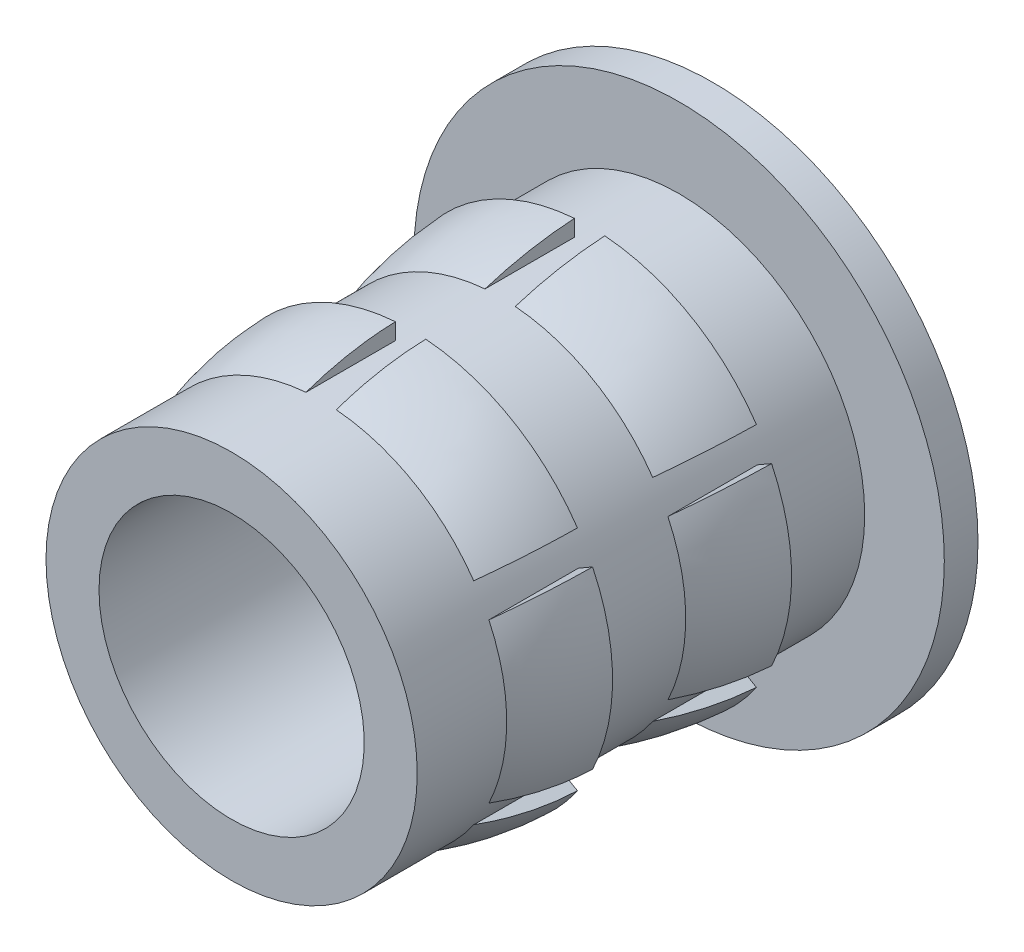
ISO-10303-21;
HEADER;
FILE_DESCRIPTION(('STEP AP214'),'2;1');
FILE_NAME('part.step','',(''),(''),'','','');
FILE_SCHEMA(('AUTOMOTIVE_DESIGN { 1 0 10303 214 1 1 1 1 }'));
ENDSEC;
DATA;
#1=APPLICATION_CONTEXT('core data for automotive mechanical design processes');
#2=APPLICATION_PROTOCOL_DEFINITION('international standard','automotive_design',2000,#1);
#3=PRODUCT_CONTEXT('',#1,'mechanical');
#4=PRODUCT('Part','Part','',(#3));
#5=PRODUCT_RELATED_PRODUCT_CATEGORY('part','',(#4));
#6=PRODUCT_DEFINITION_FORMATION('','',#4);
#7=PRODUCT_DEFINITION_CONTEXT('part definition',#1,'design');
#8=PRODUCT_DEFINITION('design','',#6,#7);
#9=PRODUCT_DEFINITION_SHAPE('','',#8);
#10=(LENGTH_UNIT() NAMED_UNIT(*) SI_UNIT(.MILLI.,.METRE.));
#11=(NAMED_UNIT(*) PLANE_ANGLE_UNIT() SI_UNIT($,.RADIAN.));
#12=(NAMED_UNIT(*) SI_UNIT($,.STERADIAN.) SOLID_ANGLE_UNIT());
#13=UNCERTAINTY_MEASURE_WITH_UNIT(LENGTH_MEASURE(1.E-05),#10,'distance_accuracy_value','');
#14=(GEOMETRIC_REPRESENTATION_CONTEXT(3) GLOBAL_UNCERTAINTY_ASSIGNED_CONTEXT((#13)) GLOBAL_UNIT_ASSIGNED_CONTEXT((#10,
#11,#12)) REPRESENTATION_CONTEXT('',''));
#15=CARTESIAN_POINT('',(0.,0.,0.));
#16=DIRECTION('',(0.,0.,1.));
#17=DIRECTION('',(1.,0.,0.));
#18=AXIS2_PLACEMENT_3D('',#15,#16,#17);
#19=CARTESIAN_POINT('',(6.13434757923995,0.,-55.2887828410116));
#20=DIRECTION('',(0.,0.,-1.));
#21=DIRECTION('',(-1.,0.,0.));
#22=AXIS2_PLACEMENT_3D('',#19,#20,#21);
#23=CYLINDRICAL_SURFACE('',#22,7.);
#24=CARTESIAN_POINT('',(6.13434757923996,0.,-21.0048107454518));
#25=DIRECTION('',(0.,0.,-1.));
#26=DIRECTION('',(-1.,0.,0.));
#27=AXIS2_PLACEMENT_3D('',#24,#25,#26);
#28=CIRCLE('',#27,7.);
#29=CARTESIAN_POINT('',(-0.865652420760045,0.,-21.0048107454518));
#30=VERTEX_POINT('',#29);
#31=EDGE_CURVE('E329',#30,#30,#28,.T.);
#32=ORIENTED_EDGE('',*,*,#31,.T.);
#33=EDGE_LOOP('',(#32));
#34=FACE_BOUND('',#33,.T.);
#35=CARTESIAN_POINT('',(6.13434757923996,0.,-21.8938107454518));
#36=DIRECTION('',(0.,0.,-1.));
#37=DIRECTION('',(-1.,0.,0.));
#38=AXIS2_PLACEMENT_3D('',#35,#36,#37);
#39=CIRCLE('',#38,7.);
#40=CARTESIAN_POINT('',(-0.865652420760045,0.,-21.8938107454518));
#41=VERTEX_POINT('',#40);
#42=EDGE_CURVE('E260',#41,#41,#39,.F.);
#43=ORIENTED_EDGE('',*,*,#42,.T.);
#44=EDGE_LOOP('',(#43));
#45=FACE_BOUND('',#44,.T.);
#46=ADVANCED_FACE('F17',(#34,#45),#23,.T.);
#47=CARTESIAN_POINT('',(2.105941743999,2.78768140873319,-19.1938107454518));
#48=DIRECTION('',(0.50000000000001,0.866025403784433,0.));
#49=DIRECTION('',(-0.866025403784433,0.50000000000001,0.));
#50=AXIS2_PLACEMENT_3D('',#47,#48,#49);
#51=PLANE('',#50);
#52=CARTESIAN_POINT('',(1.73084110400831,3.00424586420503,-18.6426107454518));
#53=CARTESIAN_POINT('',(1.7358651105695,3.00134525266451,-18.5421213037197));
#54=CARTESIAN_POINT('',(1.74223966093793,2.99766490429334,-18.4417219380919));
#55=CARTESIAN_POINT('',(1.75765973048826,2.98876212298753,-18.2414862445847));
#56=CARTESIAN_POINT('',(1.7666975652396,2.98354412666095,-18.1416491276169));
#57=CARTESIAN_POINT('',(1.78742315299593,2.97157820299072,-17.9425352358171));
#58=CARTESIAN_POINT('',(1.79910582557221,2.96483320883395,-17.8432577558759));
#59=CARTESIAN_POINT('',(1.82510712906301,2.94982134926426,-17.6452612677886));
#60=CARTESIAN_POINT('',(1.83942322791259,2.94155594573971,-17.5465418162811));
#61=CARTESIAN_POINT('',(1.87068540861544,2.92350671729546,-17.3496596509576));
#62=CARTESIAN_POINT('',(1.88763149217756,2.91372289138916,-17.2514969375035));
#63=CARTESIAN_POINT('',(1.92415518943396,2.89263592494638,-17.0557281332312));
#64=CARTESIAN_POINT('',(1.94373530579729,2.88133133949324,-16.9581226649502));
#65=CARTESIAN_POINT('',(1.9855362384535,2.85719755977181,-16.7634708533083));
#66=CARTESIAN_POINT('',(2.00776202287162,2.84436549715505,-16.6664259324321));
#67=CARTESIAN_POINT('',(2.05487039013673,2.81716746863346,-16.4728995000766));
#68=CARTESIAN_POINT('',(2.07976040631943,2.80279721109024,-16.3764204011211));
#69=CARTESIAN_POINT('',(2.10594174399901,2.78768140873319,-16.2804107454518));
#70=B_SPLINE_CURVE_WITH_KNOTS('',3,(#52,#53,#54,#55,#56,#57,#58,#59,#60,#61,#62,#63,#64,#65,#66,
#67,#68,#69),.UNSPECIFIED.,.F.,.F.,(4,2,2,2,2,2,2,2,4),(0.,0.301958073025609,0.603053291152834,
0.903574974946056,1.20380920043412,1.50404362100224,1.80456534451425,2.10566057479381,
2.40761892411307),.UNSPECIFIED.);
#71=CARTESIAN_POINT('',(1.73084110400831,3.00424586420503,-18.6426107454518));
#72=VERTEX_POINT('',#71);
#73=CARTESIAN_POINT('',(2.10594174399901,2.78768140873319,-16.2804107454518));
#74=VERTEX_POINT('',#73);
#75=EDGE_CURVE('E221',#72,#74,#70,.T.);
#76=ORIENTED_EDGE('',*,*,#75,.F.);
#77=DIRECTION('',(0.866025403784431,-0.500000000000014,0.));
#78=VECTOR('',#77,1.);
#79=CARTESIAN_POINT('',(1.73084110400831,3.00424586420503,-18.6426107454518));
#80=LINE('',#79,#78);
#81=CARTESIAN_POINT('',(2.10594174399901,2.78768140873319,-18.6426107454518));
#82=VERTEX_POINT('',#81);
#83=EDGE_CURVE('E209',#72,#82,#80,.T.);
#84=ORIENTED_EDGE('',*,*,#83,.T.);
#85=DIRECTION('',(0.,0.,-1.));
#86=VECTOR('',#85,1.);
#87=CARTESIAN_POINT('',(2.105941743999,2.78768140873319,-55.2887828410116));
#88=LINE('',#87,#86);
#89=EDGE_CURVE('E226',#74,#82,#88,.T.);
#90=ORIENTED_EDGE('',*,*,#89,.F.);
#91=EDGE_LOOP('',(#76,#84,#90));
#92=FACE_BOUND('',#91,.T.);
#93=ADVANCED_FACE('F224',(#92),#51,.F.);
#94=CARTESIAN_POINT('',(11.03324757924,0.,-18.6426107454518));
#95=DIRECTION('',(0.,0.,1.));
#96=DIRECTION('',(1.,0.,0.));
#97=AXIS2_PLACEMENT_3D('',#94,#95,#96);
#98=PLANE('',#97);
#99=ORIENTED_EDGE('',*,*,#83,.F.);
#100=CARTESIAN_POINT('',(6.13434757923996,0.,-18.6426107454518));
#101=DIRECTION('',(0.,0.,-1.));
#102=DIRECTION('',(-1.,0.,0.));
#103=AXIS2_PLACEMENT_3D('',#100,#101,#102);
#104=CIRCLE('',#103,5.3307);
#105=CARTESIAN_POINT('',(5.73434757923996,5.31567140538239,-18.6426107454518));
#106=VERTEX_POINT('',#105);
#107=EDGE_CURVE('E20',#106,#72,#104,.F.);
#108=ORIENTED_EDGE('',*,*,#107,.F.);
#109=DIRECTION('',(0.,1.,0.));
#110=VECTOR('',#109,1.);
#111=CARTESIAN_POINT('',(5.73434757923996,4.88254249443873,-18.6426107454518));
#112=LINE('',#111,#110);
#113=CARTESIAN_POINT('',(5.73434757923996,4.88254249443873,-18.6426107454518));
#114=VERTEX_POINT('',#113);
#115=EDGE_CURVE('E202',#106,#114,#112,.F.);
#116=ORIENTED_EDGE('',*,*,#115,.T.);
#117=CARTESIAN_POINT('',(6.13434757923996,0.,-18.6426107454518));
#118=DIRECTION('',(0.,0.,-1.));
#119=DIRECTION('',(-1.,0.,0.));
#120=AXIS2_PLACEMENT_3D('',#117,#118,#119);
#121=CIRCLE('',#120,4.8989);
#122=EDGE_CURVE('E213',#82,#114,#121,.T.);
#123=ORIENTED_EDGE('',*,*,#122,.F.);
#124=EDGE_LOOP('',(#99,#108,#116,#123));
#125=FACE_BOUND('',#124,.T.);
#126=ADVANCED_FACE('F211',(#125),#98,.F.);
#127=CARTESIAN_POINT('',(5.73434757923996,4.88254249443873,-19.1938107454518));
#128=DIRECTION('',(-1.,0.,0.));
#129=DIRECTION('',(0.,0.,1.));
#130=AXIS2_PLACEMENT_3D('',#127,#128,#129);
#131=PLANE('',#130);
#132=DIRECTION('',(0.,0.,-1.));
#133=VECTOR('',#132,1.);
#134=CARTESIAN_POINT('',(5.73434757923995,4.88254249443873,-55.2887828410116));
#135=LINE('',#134,#133);
#136=CARTESIAN_POINT('',(5.73434757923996,4.88254249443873,-16.2804107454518));
#137=VERTEX_POINT('',#136);
#138=EDGE_CURVE('E254',#114,#137,#135,.F.);
#139=ORIENTED_EDGE('',*,*,#138,.F.);
#140=ORIENTED_EDGE('',*,*,#115,.F.);
#141=CARTESIAN_POINT('',(5.73434757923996,4.88254249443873,-16.2804107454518));
#142=CARTESIAN_POINT('',(5.73434757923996,4.91277409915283,-16.3764204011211));
#143=CARTESIAN_POINT('',(5.73434757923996,4.94151461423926,-16.4728995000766));
#144=CARTESIAN_POINT('',(5.73434757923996,4.99591067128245,-16.6664259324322));
#145=CARTESIAN_POINT('',(5.73434757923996,5.02157479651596,-16.7634708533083));
#146=CARTESIAN_POINT('',(5.73434757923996,5.06984235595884,-16.9581226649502));
#147=CARTESIAN_POINT('',(5.73434757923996,5.0924515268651,-17.0557281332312));
#148=CARTESIAN_POINT('',(5.73434757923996,5.13462545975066,-17.2514969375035));
#149=CARTESIAN_POINT('',(5.73434757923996,5.15419311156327,-17.3496596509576));
#150=CARTESIAN_POINT('',(5.73434757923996,5.19029156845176,-17.5465418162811));
#151=CARTESIAN_POINT('',(5.73434757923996,5.20682237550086,-17.6452612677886));
#152=CARTESIAN_POINT('',(5.73434757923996,5.23684609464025,-17.8432577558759));
#153=CARTESIAN_POINT('',(5.73434757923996,5.25033608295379,-17.9425352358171));
#154=CARTESIAN_POINT('',(5.73434757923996,5.27426793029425,-18.1416491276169));
#155=CARTESIAN_POINT('',(5.73434757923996,5.28470392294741,-18.2414862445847));
#156=CARTESIAN_POINT('',(5.73434757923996,5.30250948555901,-18.4417219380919));
#157=CARTESIAN_POINT('',(5.73434757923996,5.30987018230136,-18.5421213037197));
#158=CARTESIAN_POINT('',(5.73434757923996,5.31567140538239,-18.6426107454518));
#159=B_SPLINE_CURVE_WITH_KNOTS('',3,(#141,#142,#143,#144,#145,#146,#147,#148,#149,#150,#151,
#152,#153,#154,#155,#156,#157,#158),.UNSPECIFIED.,.F.,.F.,(4,2,2,2,2,2,2,2,4),(0.,
0.301958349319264,0.603053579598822,0.903575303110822,1.20380972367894,1.504043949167,
1.80456563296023,2.10566085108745,2.40761892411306),.UNSPECIFIED.);
#160=EDGE_CURVE('E223',#137,#106,#159,.T.);
#161=ORIENTED_EDGE('',*,*,#160,.F.);
#162=EDGE_LOOP('',(#139,#140,#161));
#163=FACE_BOUND('',#162,.T.);
#164=ADVANCED_FACE('F245',(#163),#131,.F.);
#165=CARTESIAN_POINT('',(10.5507432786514,0.,-19.2037723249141));
#166=DIRECTION('',(0.,1.,0.));
#167=DIRECTION('',(-1.,0.,0.));
#168=AXIS2_PLACEMENT_3D('',#165,#166,#167);
#169=CIRCLE('',#168,9.76323598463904);
#170=TRIMMED_CURVE('',#169,(PARAMETER_VALUE(-1.1013982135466)),
(PARAMETER_VALUE(1.1013982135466)),.T.,.PARAMETER.);
#171=CARTESIAN_POINT('',(6.13434757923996,0.,-19.2037723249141));
#172=DIRECTION('',(0.,0.,-1.));
#173=AXIS1_PLACEMENT('',#171,#172);
#174=SURFACE_OF_REVOLUTION('',#170,#173);
#175=CARTESIAN_POINT('',(6.13434757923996,0.,-16.2804107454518));
#176=DIRECTION('',(0.,0.,-1.));
#177=DIRECTION('',(-1.,0.,0.));
#178=AXIS2_PLACEMENT_3D('',#175,#176,#177);
#179=CIRCLE('',#178,4.8989);
#180=EDGE_CURVE('E256',#137,#74,#179,.F.);
#181=ORIENTED_EDGE('',*,*,#180,.F.);
#182=ORIENTED_EDGE('',*,*,#160,.T.);
#183=ORIENTED_EDGE('',*,*,#107,.T.);
#184=ORIENTED_EDGE('',*,*,#75,.T.);
#185=EDGE_LOOP('',(#181,#182,#183,#184));
#186=FACE_BOUND('',#185,.T.);
#187=ADVANCED_FACE('F220',(#186),#174,.F.);
#188=CARTESIAN_POINT('',(2.105941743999,2.78768140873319,-19.1938107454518));
#189=DIRECTION('',(0.50000000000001,0.866025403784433,0.));
#190=DIRECTION('',(-0.866025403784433,0.50000000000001,0.));
#191=AXIS2_PLACEMENT_3D('',#188,#189,#190);
#192=PLANE('',#191);
#193=CARTESIAN_POINT('',(1.73084110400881,3.00424586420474,-13.9182107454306));
#194=CARTESIAN_POINT('',(1.7327289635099,3.0031559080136,-13.8374095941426));
#195=CARTESIAN_POINT('',(1.73570381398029,3.00143837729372,-13.7566423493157));
#196=CARTESIAN_POINT('',(1.7438076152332,2.99675964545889,-13.5955595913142));
#197=CARTESIAN_POINT('',(1.74892834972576,2.99380318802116,-13.5152435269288));
#198=CARTESIAN_POINT('',(1.76130085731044,2.98665991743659,-13.3550606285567));
#199=CARTESIAN_POINT('',(1.76854653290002,2.98247662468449,-13.2751931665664));
#200=CARTESIAN_POINT('',(1.78515160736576,2.97288968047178,-13.1159055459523));
#201=CARTESIAN_POINT('',(1.79450696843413,2.96748836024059,-13.0364848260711));
#202=CARTESIAN_POINT('',(1.81532038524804,2.95547172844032,-12.8780893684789));
#203=CARTESIAN_POINT('',(1.82677641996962,2.94885758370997,-12.7991142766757));
#204=CARTESIAN_POINT('',(1.85178636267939,2.93441808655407,-12.6416081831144));
#205=CARTESIAN_POINT('',(1.86534027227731,2.92659273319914,-12.563077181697));
#206=CARTESIAN_POINT('',(1.89454723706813,2.90973008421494,-12.4064586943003));
#207=CARTESIAN_POINT('',(1.91020228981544,2.90069163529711,-12.3283717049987));
#208=CARTESIAN_POINT('',(1.94361856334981,2.88139874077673,-12.1726433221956));
#209=CARTESIAN_POINT('',(1.96138373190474,2.87114201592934,-12.0950030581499));
#210=CARTESIAN_POINT('',(1.99903334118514,2.84940500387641,-11.9401719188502));
#211=CARTESIAN_POINT('',(2.01892367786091,2.83792131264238,-11.8629829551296));
#212=CARTESIAN_POINT('',(2.06084227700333,2.81371959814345,-11.7090597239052));
#213=CARTESIAN_POINT('',(2.08287839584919,2.80099703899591,-11.6323283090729));
#214=CARTESIAN_POINT('',(2.10594174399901,2.78768140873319,-11.5560107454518));
#215=B_SPLINE_CURVE_WITH_KNOTS('',3,(#193,#194,#195,#196,#197,#198,#199,#200,#201,#202,#203,
#204,#205,#206,#207,#208,#209,#210,#211,#212,#213,#214),.UNSPECIFIED.,.F.,.F.,(4,2,2,2,2,2,2,2,
2,2,4),(0.,0.24248183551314,0.484043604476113,0.724918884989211,0.965337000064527,
1.20552501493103,1.44571321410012,1.68613139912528,1.92700667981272,2.16856849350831,
2.41105061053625),.UNSPECIFIED.);
#216=CARTESIAN_POINT('',(1.73084110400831,3.00424586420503,-13.9182107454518));
#217=VERTEX_POINT('',#216);
#218=CARTESIAN_POINT('',(2.10594174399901,2.78768140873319,-11.5560107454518));
#219=VERTEX_POINT('',#218);
#220=EDGE_CURVE('E694',#217,#219,#215,.T.);
#221=ORIENTED_EDGE('',*,*,#220,.F.);
#222=DIRECTION('',(0.866025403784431,-0.500000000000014,0.));
#223=VECTOR('',#222,1.);
#224=CARTESIAN_POINT('',(1.73084110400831,3.00424586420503,-13.9182107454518));
#225=LINE('',#224,#223);
#226=CARTESIAN_POINT('',(2.10594174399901,2.78768140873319,-13.9182107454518));
#227=VERTEX_POINT('',#226);
#228=EDGE_CURVE('E227',#217,#227,#225,.T.);
#229=ORIENTED_EDGE('',*,*,#228,.T.);
#230=DIRECTION('',(0.,0.,-1.));
#231=VECTOR('',#230,1.);
#232=CARTESIAN_POINT('',(2.105941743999,2.78768140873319,-55.2887828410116));
#233=LINE('',#232,#231);
#234=EDGE_CURVE('E258',#219,#227,#233,.T.);
#235=ORIENTED_EDGE('',*,*,#234,.F.);
#236=EDGE_LOOP('',(#221,#229,#235));
#237=FACE_BOUND('',#236,.T.);
#238=ADVANCED_FACE('F244',(#237),#192,.F.);
#239=CARTESIAN_POINT('',(11.03324757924,0.,-13.9182107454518));
#240=DIRECTION('',(0.,0.,1.));
#241=DIRECTION('',(1.,0.,0.));
#242=AXIS2_PLACEMENT_3D('',#239,#240,#241);
#243=PLANE('',#242);
#244=ORIENTED_EDGE('',*,*,#228,.F.);
#245=CARTESIAN_POINT('',(6.13434757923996,0.,-13.9182107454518));
#246=DIRECTION('',(0.,0.,-1.));
#247=DIRECTION('',(-1.,0.,0.));
#248=AXIS2_PLACEMENT_3D('',#245,#246,#247);
#249=CIRCLE('',#248,5.3307);
#250=CARTESIAN_POINT('',(5.73434757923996,5.31567140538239,-13.9182107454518));
#251=VERTEX_POINT('',#250);
#252=EDGE_CURVE('E715',#251,#217,#249,.F.);
#253=ORIENTED_EDGE('',*,*,#252,.F.);
#254=DIRECTION('',(0.,1.,0.));
#255=VECTOR('',#254,1.);
#256=CARTESIAN_POINT('',(5.73434757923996,4.88254249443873,-13.9182107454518));
#257=LINE('',#256,#255);
#258=CARTESIAN_POINT('',(5.73434757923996,4.88254249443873,-13.9182107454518));
#259=VERTEX_POINT('',#258);
#260=EDGE_CURVE('E713',#251,#259,#257,.F.);
#261=ORIENTED_EDGE('',*,*,#260,.T.);
#262=CARTESIAN_POINT('',(6.13434757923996,0.,-13.9182107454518));
#263=DIRECTION('',(0.,0.,-1.));
#264=DIRECTION('',(-1.,0.,0.));
#265=AXIS2_PLACEMENT_3D('',#262,#263,#264);
#266=CIRCLE('',#265,4.8989);
#267=EDGE_CURVE('E322',#227,#259,#266,.T.);
#268=ORIENTED_EDGE('',*,*,#267,.F.);
#269=EDGE_LOOP('',(#244,#253,#261,#268));
#270=FACE_BOUND('',#269,.T.);
#271=ADVANCED_FACE('F726',(#270),#243,.F.);
#272=CARTESIAN_POINT('',(5.73434757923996,4.88254249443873,-19.1938107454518));
#273=DIRECTION('',(-1.,0.,0.));
#274=DIRECTION('',(0.,0.,1.));
#275=AXIS2_PLACEMENT_3D('',#272,#273,#274);
#276=PLANE('',#275);
#277=DIRECTION('',(0.,0.,-1.));
#278=VECTOR('',#277,1.);
#279=CARTESIAN_POINT('',(5.73434757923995,4.88254249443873,-55.2887828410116));
#280=LINE('',#279,#278);
#281=CARTESIAN_POINT('',(5.73434757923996,4.88254249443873,-11.5560107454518));
#282=VERTEX_POINT('',#281);
#283=EDGE_CURVE('E325',#259,#282,#280,.F.);
#284=ORIENTED_EDGE('',*,*,#283,.F.);
#285=ORIENTED_EDGE('',*,*,#260,.F.);
#286=CARTESIAN_POINT('',(5.73434757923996,4.88254249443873,-11.5560107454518));
#287=CARTESIAN_POINT('',(5.73434757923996,4.9091737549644,-11.6323283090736));
#288=CARTESIAN_POINT('',(5.73434757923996,4.93461887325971,-11.7090597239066));
#289=CARTESIAN_POINT('',(5.73434757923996,4.98302230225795,-11.8629829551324));
#290=CARTESIAN_POINT('',(5.73434757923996,5.00598968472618,-11.9401719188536));
#291=CARTESIAN_POINT('',(5.73434757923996,5.04946370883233,-12.0950030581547));
#292=CARTESIAN_POINT('',(5.73434757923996,5.06997715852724,-12.1726433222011));
#293=CARTESIAN_POINT('',(5.73434757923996,5.10856294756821,-12.3283717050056));
#294=CARTESIAN_POINT('',(5.73434757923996,5.12663984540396,-12.4064586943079));
#295=CARTESIAN_POINT('',(5.73434757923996,5.16036514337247,-12.563077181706));
#296=CARTESIAN_POINT('',(5.73434757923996,5.17601585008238,-12.6416081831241));
#297=CARTESIAN_POINT('',(5.73434757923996,5.20489484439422,-12.7991142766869));
#298=CARTESIAN_POINT('',(5.73434757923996,5.21812313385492,-12.8780893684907));
#299=CARTESIAN_POINT('',(5.73434757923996,5.2421563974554,-13.0364848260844));
#300=CARTESIAN_POINT('',(5.73434757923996,5.25295903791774,-13.1159055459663));
#301=CARTESIAN_POINT('',(5.73434757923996,5.27213292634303,-13.2751931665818));
#302=CARTESIAN_POINT('',(5.73434757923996,5.28049951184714,-13.3550606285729));
#303=CARTESIAN_POINT('',(5.73434757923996,5.29478605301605,-13.5152435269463));
#304=CARTESIAN_POINT('',(5.73434757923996,5.30069896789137,-13.5955595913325));
#305=CARTESIAN_POINT('',(5.73434757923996,5.31005643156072,-13.7566423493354));
#306=CARTESIAN_POINT('',(5.73434757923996,5.3134914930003,-13.837409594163));
#307=CARTESIAN_POINT('',(5.73434757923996,5.31567140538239,-13.9182107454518));
#308=B_SPLINE_CURVE_WITH_KNOTS('',3,(#286,#287,#288,#289,#290,#291,#292,#293,#294,#295,#296,
#297,#298,#299,#300,#301,#302,#303,#304,#305,#306,#307),.UNSPECIFIED.,.F.,.F.,(4,2,2,2,2,2,2,2,
2,2,4),(0.,0.242482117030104,0.484043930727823,0.724919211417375,0.96533739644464,
1.20552559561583,1.44571361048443,1.68613172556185,1.92700700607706,2.16856877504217,
2.41105061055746),.UNSPECIFIED.);
#309=EDGE_CURVE('E686',#282,#251,#308,.T.);
#310=ORIENTED_EDGE('',*,*,#309,.F.);
#311=EDGE_LOOP('',(#284,#285,#310));
#312=FACE_BOUND('',#311,.T.);
#313=ADVANCED_FACE('F698',(#312),#276,.F.);
#314=CARTESIAN_POINT('',(8.63342071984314,0.,-14.1288940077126));
#315=DIRECTION('',(0.,1.,0.));
#316=DIRECTION('',(-1.,0.,0.));
#317=AXIS2_PLACEMENT_3D('',#314,#315,#316);
#318=CIRCLE('',#317,7.83260715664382);
#319=TRIMMED_CURVE('',#318,(PARAMETER_VALUE(-1.24605864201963)),
(PARAMETER_VALUE(1.24605864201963)),.T.,.PARAMETER.);
#320=CARTESIAN_POINT('',(6.13434757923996,0.,-14.1288940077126));
#321=DIRECTION('',(0.,0.,-1.));
#322=AXIS1_PLACEMENT('',#320,#321);
#323=SURFACE_OF_REVOLUTION('',#319,#322);
#324=CARTESIAN_POINT('',(6.13434757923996,0.,-11.5560107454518));
#325=DIRECTION('',(0.,0.,-1.));
#326=DIRECTION('',(-1.,0.,0.));
#327=AXIS2_PLACEMENT_3D('',#324,#325,#326);
#328=CIRCLE('',#327,4.8989);
#329=EDGE_CURVE('E321',#282,#219,#328,.F.);
#330=ORIENTED_EDGE('',*,*,#329,.F.);
#331=ORIENTED_EDGE('',*,*,#309,.T.);
#332=ORIENTED_EDGE('',*,*,#252,.T.);
#333=ORIENTED_EDGE('',*,*,#220,.T.);
#334=EDGE_LOOP('',(#330,#331,#332,#333));
#335=FACE_BOUND('',#334,.T.);
#336=ADVANCED_FACE('F700',(#335),#323,.F.);
#337=CARTESIAN_POINT('',(11.03324757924,0.,-18.6426107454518));
#338=DIRECTION('',(0.,0.,1.));
#339=DIRECTION('',(1.,0.,0.));
#340=AXIS2_PLACEMENT_3D('',#337,#338,#339);
#341=PLANE('',#340);
#342=DIRECTION('',(0.866025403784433,-0.50000000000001,0.));
#343=VECTOR('',#342,1.);
#344=CARTESIAN_POINT('',(1.705941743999,2.09486108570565,-18.6426107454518));
#345=LINE('',#344,#343);
#346=CARTESIAN_POINT('',(1.33084110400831,2.31142554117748,-18.6426107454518));
#347=VERTEX_POINT('',#346);
#348=CARTESIAN_POINT('',(1.705941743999,2.09486108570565,-18.6426107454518));
#349=VERTEX_POINT('',#348);
#350=EDGE_CURVE('E685',#347,#349,#345,.T.);
#351=ORIENTED_EDGE('',*,*,#350,.T.);
#352=CARTESIAN_POINT('',(6.13434757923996,0.,-18.6426107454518));
#353=DIRECTION('',(0.,0.,-1.));
#354=DIRECTION('',(-1.,0.,0.));
#355=AXIS2_PLACEMENT_3D('',#352,#353,#354);
#356=CIRCLE('',#355,4.8989);
#357=CARTESIAN_POINT('',(1.70594174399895,-2.09486108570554,-18.6426107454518));
#358=VERTEX_POINT('',#357);
#359=EDGE_CURVE('E317',#358,#349,#356,.T.);
#360=ORIENTED_EDGE('',*,*,#359,.F.);
#361=DIRECTION('',(-0.866025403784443,-0.499999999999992,0.));
#362=VECTOR('',#361,1.);
#363=CARTESIAN_POINT('',(1.70594174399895,-2.09486108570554,-18.6426107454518));
#364=LINE('',#363,#362);
#365=CARTESIAN_POINT('',(1.33084110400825,-2.31142554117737,-18.6426107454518));
#366=VERTEX_POINT('',#365);
#367=EDGE_CURVE('E649',#358,#366,#364,.T.);
#368=ORIENTED_EDGE('',*,*,#367,.T.);
#369=CARTESIAN_POINT('',(6.13434757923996,0.,-18.6426107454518));
#370=DIRECTION('',(0.,0.,-1.));
#371=DIRECTION('',(-1.,0.,0.));
#372=AXIS2_PLACEMENT_3D('',#369,#370,#371);
#373=CIRCLE('',#372,5.3307);
#374=EDGE_CURVE('E652',#347,#366,#373,.F.);
#375=ORIENTED_EDGE('',*,*,#374,.F.);
#376=EDGE_LOOP('',(#351,#360,#368,#375));
#377=FACE_BOUND('',#376,.T.);
#378=ADVANCED_FACE('F704',(#377),#341,.F.);
#379=CARTESIAN_POINT('',(1.705941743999,2.09486108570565,-19.1938107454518));
#380=DIRECTION('',(-0.50000000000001,-0.866025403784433,0.));
#381=DIRECTION('',(0.866025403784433,-0.50000000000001,0.));
#382=AXIS2_PLACEMENT_3D('',#379,#380,#381);
#383=PLANE('',#382);
#384=DIRECTION('',(0.,0.,-1.));
#385=VECTOR('',#384,1.);
#386=CARTESIAN_POINT('',(1.70594174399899,2.09486108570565,-55.2887828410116));
#387=LINE('',#386,#385);
#388=CARTESIAN_POINT('',(1.705941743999,2.09486108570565,-16.2804107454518));
#389=VERTEX_POINT('',#388);
#390=EDGE_CURVE('E320',#349,#389,#387,.F.);
#391=ORIENTED_EDGE('',*,*,#390,.F.);
#392=ORIENTED_EDGE('',*,*,#350,.F.);
#393=CARTESIAN_POINT('',(1.705941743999,2.09486108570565,-16.2804107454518));
#394=CARTESIAN_POINT('',(1.67976040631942,2.1099768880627,-16.3764204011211));
#395=CARTESIAN_POINT('',(1.65487039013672,2.12434714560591,-16.4728995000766));
#396=CARTESIAN_POINT('',(1.60776202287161,2.15154517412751,-16.6664259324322));
#397=CARTESIAN_POINT('',(1.58553623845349,2.16437723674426,-16.7634708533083));
#398=CARTESIAN_POINT('',(1.54373530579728,2.1885110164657,-16.9581226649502));
#399=CARTESIAN_POINT('',(1.52415518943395,2.19981560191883,-17.0557281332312));
#400=CARTESIAN_POINT('',(1.48763149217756,2.22090256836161,-17.2514969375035));
#401=CARTESIAN_POINT('',(1.47068540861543,2.23068639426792,-17.3496596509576));
#402=CARTESIAN_POINT('',(1.43942322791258,2.24873562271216,-17.5465418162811));
#403=CARTESIAN_POINT('',(1.425107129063,2.25700102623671,-17.6452612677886));
#404=CARTESIAN_POINT('',(1.3991058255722,2.27201288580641,-17.8432577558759));
#405=CARTESIAN_POINT('',(1.38742315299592,2.27875787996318,-17.9425352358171));
#406=CARTESIAN_POINT('',(1.3666975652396,2.29072380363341,-18.1416491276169));
#407=CARTESIAN_POINT('',(1.35765973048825,2.29594179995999,-18.2414862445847));
#408=CARTESIAN_POINT('',(1.34223966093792,2.30484458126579,-18.4417219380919));
#409=CARTESIAN_POINT('',(1.33586511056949,2.30852492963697,-18.5421213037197));
#410=CARTESIAN_POINT('',(1.33084110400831,2.31142554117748,-18.6426107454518));
#411=B_SPLINE_CURVE_WITH_KNOTS('',3,(#393,#394,#395,#396,#397,#398,#399,#400,#401,#402,#403,
#404,#405,#406,#407,#408,#409,#410),.UNSPECIFIED.,.F.,.F.,(4,2,2,2,2,2,2,2,4),(0.,
0.301958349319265,0.603053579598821,0.903575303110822,1.20380972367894,1.504043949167,
1.80456563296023,2.10566085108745,2.40761892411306),.UNSPECIFIED.);
#412=EDGE_CURVE('E679',#389,#347,#411,.T.);
#413=ORIENTED_EDGE('',*,*,#412,.F.);
#414=EDGE_LOOP('',(#391,#392,#413));
#415=FACE_BOUND('',#414,.T.);
#416=ADVANCED_FACE('F667',(#415),#383,.F.);
#417=CARTESIAN_POINT('',(10.5507432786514,0.,-19.2037723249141));
#418=DIRECTION('',(0.,1.,0.));
#419=DIRECTION('',(-1.,0.,0.));
#420=AXIS2_PLACEMENT_3D('',#417,#418,#419);
#421=CIRCLE('',#420,9.76323598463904);
#422=TRIMMED_CURVE('',#421,(PARAMETER_VALUE(-1.1013982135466)),
(PARAMETER_VALUE(1.1013982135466)),.T.,.PARAMETER.);
#423=CARTESIAN_POINT('',(6.13434757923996,0.,-19.2037723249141));
#424=DIRECTION('',(0.,0.,-1.));
#425=AXIS1_PLACEMENT('',#423,#424);
#426=SURFACE_OF_REVOLUTION('',#422,#425);
#427=ORIENTED_EDGE('',*,*,#374,.T.);
#428=CARTESIAN_POINT('',(1.33084110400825,-2.31142554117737,-18.6426107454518));
#429=CARTESIAN_POINT('',(1.33586511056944,-2.30852492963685,-18.5421213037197));
#430=CARTESIAN_POINT('',(1.34223966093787,-2.30484458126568,-18.4417219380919));
#431=CARTESIAN_POINT('',(1.3576597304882,-2.29594179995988,-18.2414862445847));
#432=CARTESIAN_POINT('',(1.36669756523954,-2.2907238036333,-18.1416491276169));
#433=CARTESIAN_POINT('',(1.38742315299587,-2.27875787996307,-17.9425352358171));
#434=CARTESIAN_POINT('',(1.39910582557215,-2.2720128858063,-17.8432577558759));
#435=CARTESIAN_POINT('',(1.42510712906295,-2.2570010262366,-17.6452612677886));
#436=CARTESIAN_POINT('',(1.43942322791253,-2.24873562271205,-17.5465418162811));
#437=CARTESIAN_POINT('',(1.47068540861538,-2.23068639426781,-17.3496596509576));
#438=CARTESIAN_POINT('',(1.48763149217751,-2.2209025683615,-17.2514969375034));
#439=CARTESIAN_POINT('',(1.5241551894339,-2.19981560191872,-17.0557281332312));
#440=CARTESIAN_POINT('',(1.54373530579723,-2.18851101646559,-16.9581226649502));
#441=CARTESIAN_POINT('',(1.58553623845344,-2.16437723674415,-16.7634708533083));
#442=CARTESIAN_POINT('',(1.60776202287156,-2.1515451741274,-16.6664259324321));
#443=CARTESIAN_POINT('',(1.65487039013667,-2.12434714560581,-16.4728995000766));
#444=CARTESIAN_POINT('',(1.67976040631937,-2.10997688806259,-16.3764204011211));
#445=CARTESIAN_POINT('',(1.70594174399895,-2.09486108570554,-16.2804107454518));
#446=B_SPLINE_CURVE_WITH_KNOTS('',3,(#428,#429,#430,#431,#432,#433,#434,#435,#436,#437,#438,
#439,#440,#441,#442,#443,#444,#445),.UNSPECIFIED.,.F.,.F.,(4,2,2,2,2,2,2,2,4),(0.,
0.301958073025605,0.603053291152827,0.903574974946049,1.20380920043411,1.50404362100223,
1.80456534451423,2.10566057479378,2.40761892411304),.UNSPECIFIED.);
#447=CARTESIAN_POINT('',(1.70594174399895,-2.09486108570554,-16.2804107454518));
#448=VERTEX_POINT('',#447);
#449=EDGE_CURVE('E648',#366,#448,#446,.T.);
#450=ORIENTED_EDGE('',*,*,#449,.T.);
#451=CARTESIAN_POINT('',(6.13434757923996,0.,-16.2804107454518));
#452=DIRECTION('',(0.,0.,-1.));
#453=DIRECTION('',(-1.,0.,0.));
#454=AXIS2_PLACEMENT_3D('',#451,#452,#453);
#455=CIRCLE('',#454,4.8989);
#456=EDGE_CURVE('E653',#389,#448,#455,.F.);
#457=ORIENTED_EDGE('',*,*,#456,.F.);
#458=ORIENTED_EDGE('',*,*,#412,.T.);
#459=EDGE_LOOP('',(#427,#450,#457,#458));
#460=FACE_BOUND('',#459,.T.);
#461=ADVANCED_FACE('F661',(#460),#426,.F.);
#462=CARTESIAN_POINT('',(1.70594174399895,-2.09486108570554,-19.1938107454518));
#463=DIRECTION('',(-0.499999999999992,0.866025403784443,0.));
#464=DIRECTION('',(-0.866025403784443,-0.499999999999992,0.));
#465=AXIS2_PLACEMENT_3D('',#462,#463,#464);
#466=PLANE('',#465);
#467=ORIENTED_EDGE('',*,*,#449,.F.);
#468=ORIENTED_EDGE('',*,*,#367,.F.);
#469=DIRECTION('',(0.,0.,-1.));
#470=VECTOR('',#469,1.);
#471=CARTESIAN_POINT('',(1.70594174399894,-2.09486108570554,-55.2887828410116));
#472=LINE('',#471,#470);
#473=EDGE_CURVE('E316',#448,#358,#472,.T.);
#474=ORIENTED_EDGE('',*,*,#473,.F.);
#475=EDGE_LOOP('',(#467,#468,#474));
#476=FACE_BOUND('',#475,.T.);
#477=ADVANCED_FACE('F666',(#476),#466,.F.);
#478=CARTESIAN_POINT('',(11.03324757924,0.,-13.9182107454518));
#479=DIRECTION('',(0.,0.,1.));
#480=DIRECTION('',(1.,0.,0.));
#481=AXIS2_PLACEMENT_3D('',#478,#479,#480);
#482=PLANE('',#481);
#483=DIRECTION('',(0.866025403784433,-0.50000000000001,0.));
#484=VECTOR('',#483,1.);
#485=CARTESIAN_POINT('',(1.705941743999,2.09486108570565,-13.9182107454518));
#486=LINE('',#485,#484);
#487=CARTESIAN_POINT('',(1.3308411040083,2.31142554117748,-13.9182107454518));
#488=VERTEX_POINT('',#487);
#489=CARTESIAN_POINT('',(1.705941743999,2.09486108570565,-13.9182107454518));
#490=VERTEX_POINT('',#489);
#491=EDGE_CURVE('E644',#488,#490,#486,.T.);
#492=ORIENTED_EDGE('',*,*,#491,.T.);
#493=CARTESIAN_POINT('',(6.13434757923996,0.,-13.9182107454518));
#494=DIRECTION('',(0.,0.,-1.));
#495=DIRECTION('',(-1.,0.,0.));
#496=AXIS2_PLACEMENT_3D('',#493,#494,#495);
#497=CIRCLE('',#496,4.8989);
#498=CARTESIAN_POINT('',(1.70594174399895,-2.09486108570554,-13.9182107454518));
#499=VERTEX_POINT('',#498);
#500=EDGE_CURVE('E312',#499,#490,#497,.T.);
#501=ORIENTED_EDGE('',*,*,#500,.F.);
#502=DIRECTION('',(-0.866025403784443,-0.499999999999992,0.));
#503=VECTOR('',#502,1.);
#504=CARTESIAN_POINT('',(1.70594174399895,-2.09486108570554,-13.9182107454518));
#505=LINE('',#504,#503);
#506=CARTESIAN_POINT('',(1.33084110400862,-2.31142554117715,-13.9182107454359));
#507=VERTEX_POINT('',#506);
#508=EDGE_CURVE('E623',#499,#507,#505,.T.);
#509=ORIENTED_EDGE('',*,*,#508,.T.);
#510=CARTESIAN_POINT('',(6.13434757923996,0.,-13.9182107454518));
#511=DIRECTION('',(0.,0.,-1.));
#512=DIRECTION('',(-1.,0.,0.));
#513=AXIS2_PLACEMENT_3D('',#510,#511,#512);
#514=CIRCLE('',#513,5.3307);
#515=EDGE_CURVE('E624',#488,#507,#514,.F.);
#516=ORIENTED_EDGE('',*,*,#515,.F.);
#517=EDGE_LOOP('',(#492,#501,#509,#516));
#518=FACE_BOUND('',#517,.T.);
#519=ADVANCED_FACE('F864',(#518),#482,.F.);
#520=CARTESIAN_POINT('',(1.705941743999,2.09486108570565,-19.1938107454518));
#521=DIRECTION('',(-0.50000000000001,-0.866025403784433,0.));
#522=DIRECTION('',(0.866025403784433,-0.50000000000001,0.));
#523=AXIS2_PLACEMENT_3D('',#520,#521,#522);
#524=PLANE('',#523);
#525=DIRECTION('',(0.,0.,-1.));
#526=VECTOR('',#525,1.);
#527=CARTESIAN_POINT('',(1.70594174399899,2.09486108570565,-55.2887828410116));
#528=LINE('',#527,#526);
#529=CARTESIAN_POINT('',(1.705941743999,2.09486108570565,-11.5560107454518));
#530=VERTEX_POINT('',#529);
#531=EDGE_CURVE('E315',#490,#530,#528,.F.);
#532=ORIENTED_EDGE('',*,*,#531,.F.);
#533=ORIENTED_EDGE('',*,*,#491,.F.);
#534=CARTESIAN_POINT('',(1.705941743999,2.09486108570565,-11.5560107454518));
#535=CARTESIAN_POINT('',(1.68287839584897,2.10817671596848,-11.6323283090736));
#536=CARTESIAN_POINT('',(1.66084227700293,2.12089927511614,-11.7090597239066));
#537=CARTESIAN_POINT('',(1.61892367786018,2.14510098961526,-11.8629829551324));
#538=CARTESIAN_POINT('',(1.59903334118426,2.15658468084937,-11.9401719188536));
#539=CARTESIAN_POINT('',(1.5613837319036,2.17832169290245,-12.0950030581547));
#540=CARTESIAN_POINT('',(1.54361856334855,2.1885784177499,-12.1726433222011));
#541=CARTESIAN_POINT('',(1.510202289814,2.20787131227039,-12.3283717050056));
#542=CARTESIAN_POINT('',(1.49454723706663,2.21690976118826,-12.4064586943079));
#543=CARTESIAN_POINT('',(1.4653402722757,2.23377241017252,-12.563077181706));
#544=CARTESIAN_POINT('',(1.45178636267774,2.24159776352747,-12.6416081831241));
#545=CARTESIAN_POINT('',(1.42677641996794,2.25603726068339,-12.7991142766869));
#546=CARTESIAN_POINT('',(1.41532038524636,2.26265140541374,-12.8780893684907));
#547=CARTESIAN_POINT('',(1.39450696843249,2.27466803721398,-13.0364848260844));
#548=CARTESIAN_POINT('',(1.38515160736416,2.28006935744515,-13.1159055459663));
#549=CARTESIAN_POINT('',(1.36854653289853,2.2896563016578,-13.2751931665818));
#550=CARTESIAN_POINT('',(1.36130085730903,2.29383959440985,-13.3550606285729));
#551=CARTESIAN_POINT('',(1.34892834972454,2.30098286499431,-13.5152435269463));
#552=CARTESIAN_POINT('',(1.3438076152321,2.30393932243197,-13.5955595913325));
#553=CARTESIAN_POINT('',(1.33570381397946,2.30861805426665,-13.7566423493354));
#554=CARTESIAN_POINT('',(1.33272896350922,2.31033558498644,-13.837409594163));
#555=CARTESIAN_POINT('',(1.33084110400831,2.31142554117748,-13.9182107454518));
#556=B_SPLINE_CURVE_WITH_KNOTS('',3,(#534,#535,#536,#537,#538,#539,#540,#541,#542,#543,#544,
#545,#546,#547,#548,#549,#550,#551,#552,#553,#554,#555),.UNSPECIFIED.,.F.,.F.,(4,2,2,2,2,2,2,2,
2,2,4),(0.,0.242482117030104,0.484043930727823,0.724919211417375,0.96533739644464,
1.20552559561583,1.44571361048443,1.68613172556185,1.92700700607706,2.16856877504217,
2.41105061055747),.UNSPECIFIED.);
#557=EDGE_CURVE('E647',#530,#488,#556,.T.);
#558=ORIENTED_EDGE('',*,*,#557,.F.);
#559=EDGE_LOOP('',(#532,#533,#558));
#560=FACE_BOUND('',#559,.T.);
#561=ADVANCED_FACE('F633',(#560),#524,.F.);
#562=CARTESIAN_POINT('',(8.63342071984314,0.,-14.1288940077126));
#563=DIRECTION('',(0.,1.,0.));
#564=DIRECTION('',(-1.,0.,0.));
#565=AXIS2_PLACEMENT_3D('',#562,#563,#564);
#566=CIRCLE('',#565,7.83260715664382);
#567=TRIMMED_CURVE('',#566,(PARAMETER_VALUE(-1.24605864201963)),
(PARAMETER_VALUE(1.24605864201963)),.T.,.PARAMETER.);
#568=CARTESIAN_POINT('',(6.13434757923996,0.,-14.1288940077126));
#569=DIRECTION('',(0.,0.,-1.));
#570=AXIS1_PLACEMENT('',#568,#569);
#571=SURFACE_OF_REVOLUTION('',#567,#570);
#572=ORIENTED_EDGE('',*,*,#515,.T.);
#573=CARTESIAN_POINT('',(1.33084110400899,-2.31142554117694,-13.91821074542));
#574=CARTESIAN_POINT('',(1.33272896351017,-2.31033558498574,-13.8374095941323));
#575=CARTESIAN_POINT('',(1.33570381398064,-2.30861805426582,-13.7566423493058));
#576=CARTESIAN_POINT('',(1.34380761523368,-2.30393932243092,-13.595559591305));
#577=CARTESIAN_POINT('',(1.3489283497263,-2.30098286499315,-13.51524352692));
#578=CARTESIAN_POINT('',(1.36130085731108,-2.29383959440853,-13.3550606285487));
#579=CARTESIAN_POINT('',(1.36854653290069,-2.28965630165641,-13.2751931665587));
#580=CARTESIAN_POINT('',(1.38515160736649,-2.28006935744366,-13.1159055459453));
#581=CARTESIAN_POINT('',(1.39450696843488,-2.27466803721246,-13.0364848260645));
#582=CARTESIAN_POINT('',(1.41532038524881,-2.26265140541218,-12.878089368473));
#583=CARTESIAN_POINT('',(1.4267764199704,-2.25603726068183,-12.7991142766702));
#584=CARTESIAN_POINT('',(1.45178636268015,-2.24159776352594,-12.6416081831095));
#585=CARTESIAN_POINT('',(1.46534027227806,-2.23377241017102,-12.5630771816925));
#586=CARTESIAN_POINT('',(1.49454723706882,-2.21690976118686,-12.4064586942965));
#587=CARTESIAN_POINT('',(1.51020228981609,-2.20787131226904,-12.3283717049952));
#588=CARTESIAN_POINT('',(1.54361856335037,-2.18857841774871,-12.1726433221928));
#589=CARTESIAN_POINT('',(1.56138373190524,-2.17832169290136,-12.0950030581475));
#590=CARTESIAN_POINT('',(1.59903334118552,-2.15658468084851,-11.9401719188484));
#591=CARTESIAN_POINT('',(1.61892367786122,-2.14510098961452,-11.8629829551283));
#592=CARTESIAN_POINT('',(1.66084227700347,-2.12089927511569,-11.7090597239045));
#593=CARTESIAN_POINT('',(1.68287839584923,-2.1081767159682,-11.6323283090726));
#594=CARTESIAN_POINT('',(1.70594174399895,-2.09486108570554,-11.5560107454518));
#595=B_SPLINE_CURVE_WITH_KNOTS('',3,(#573,#574,#575,#576,#577,#578,#579,#580,#581,#582,#583,
#584,#585,#586,#587,#588,#589,#590,#591,#592,#593,#594),.UNSPECIFIED.,.F.,.F.,(4,2,2,2,2,2,2,2,
2,2,4),(0.,0.242481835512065,0.484043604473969,0.72491888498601,0.965337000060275,
1.20552501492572,1.44571321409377,1.68613139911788,1.92700667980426,2.16856849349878,
2.41105061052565),.UNSPECIFIED.);
#596=CARTESIAN_POINT('',(1.70594174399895,-2.09486108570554,-11.5560107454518));
#597=VERTEX_POINT('',#596);
#598=EDGE_CURVE('E615',#507,#597,#595,.T.);
#599=ORIENTED_EDGE('',*,*,#598,.T.);
#600=CARTESIAN_POINT('',(6.13434757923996,0.,-11.5560107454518));
#601=DIRECTION('',(0.,0.,-1.));
#602=DIRECTION('',(-1.,0.,0.));
#603=AXIS2_PLACEMENT_3D('',#600,#601,#602);
#604=CIRCLE('',#603,4.8989);
#605=EDGE_CURVE('E643',#530,#597,#604,.F.);
#606=ORIENTED_EDGE('',*,*,#605,.F.);
#607=ORIENTED_EDGE('',*,*,#557,.T.);
#608=EDGE_LOOP('',(#572,#599,#606,#607));
#609=FACE_BOUND('',#608,.T.);
#610=ADVANCED_FACE('F628',(#609),#571,.F.);
#611=CARTESIAN_POINT('',(1.70594174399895,-2.09486108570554,-19.1938107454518));
#612=DIRECTION('',(-0.499999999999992,0.866025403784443,0.));
#613=DIRECTION('',(-0.866025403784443,-0.499999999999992,0.));
#614=AXIS2_PLACEMENT_3D('',#611,#612,#613);
#615=PLANE('',#614);
#616=ORIENTED_EDGE('',*,*,#598,.F.);
#617=ORIENTED_EDGE('',*,*,#508,.F.);
#618=DIRECTION('',(0.,0.,-1.));
#619=VECTOR('',#618,1.);
#620=CARTESIAN_POINT('',(1.70594174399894,-2.09486108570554,-55.2887828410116));
#621=LINE('',#620,#619);
#622=EDGE_CURVE('E311',#597,#499,#621,.T.);
#623=ORIENTED_EDGE('',*,*,#622,.F.);
#624=EDGE_LOOP('',(#616,#617,#623));
#625=FACE_BOUND('',#624,.T.);
#626=ADVANCED_FACE('F626',(#625),#615,.F.);
#627=CARTESIAN_POINT('',(11.03324757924,0.,-18.6426107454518));
#628=DIRECTION('',(0.,0.,1.));
#629=DIRECTION('',(1.,0.,0.));
#630=AXIS2_PLACEMENT_3D('',#627,#628,#629);
#631=PLANE('',#630);
#632=DIRECTION('',(0.866025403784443,0.499999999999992,0.));
#633=VECTOR('',#632,1.);
#634=CARTESIAN_POINT('',(2.10594174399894,-2.7876814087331,-18.6426107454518));
#635=LINE('',#634,#633);
#636=CARTESIAN_POINT('',(1.73084110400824,-3.00424586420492,-18.6426107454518));
#637=VERTEX_POINT('',#636);
#638=CARTESIAN_POINT('',(2.10594174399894,-2.7876814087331,-18.6426107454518));
#639=VERTEX_POINT('',#638);
#640=EDGE_CURVE('E614',#637,#639,#635,.T.);
#641=ORIENTED_EDGE('',*,*,#640,.T.);
#642=CARTESIAN_POINT('',(6.13434757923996,0.,-18.6426107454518));
#643=DIRECTION('',(0.,0.,-1.));
#644=DIRECTION('',(-1.,0.,0.));
#645=AXIS2_PLACEMENT_3D('',#642,#643,#644);
#646=CIRCLE('',#645,4.8989);
#647=CARTESIAN_POINT('',(5.73434757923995,-4.88254249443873,-18.6426107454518));
#648=VERTEX_POINT('',#647);
#649=EDGE_CURVE('E307',#648,#639,#646,.T.);
#650=ORIENTED_EDGE('',*,*,#649,.F.);
#651=DIRECTION('',(0.,1.,0.));
#652=VECTOR('',#651,1.);
#653=CARTESIAN_POINT('',(5.73434757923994,-4.88254249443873,-18.6426107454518));
#654=LINE('',#653,#652);
#655=CARTESIAN_POINT('',(5.73434757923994,-5.31567140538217,-18.642610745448));
#656=VERTEX_POINT('',#655);
#657=EDGE_CURVE('E578',#648,#656,#654,.F.);
#658=ORIENTED_EDGE('',*,*,#657,.T.);
#659=CARTESIAN_POINT('',(6.13434757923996,0.,-18.6426107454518));
#660=DIRECTION('',(0.,0.,-1.));
#661=DIRECTION('',(-1.,0.,0.));
#662=AXIS2_PLACEMENT_3D('',#659,#660,#661);
#663=CIRCLE('',#662,5.3307);
#664=EDGE_CURVE('E581',#637,#656,#663,.F.);
#665=ORIENTED_EDGE('',*,*,#664,.F.);
#666=EDGE_LOOP('',(#641,#650,#658,#665));
#667=FACE_BOUND('',#666,.T.);
#668=ADVANCED_FACE('F891',(#667),#631,.F.);
#669=CARTESIAN_POINT('',(2.10594174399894,-2.7876814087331,-19.1938107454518));
#670=DIRECTION('',(0.499999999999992,-0.866025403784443,0.));
#671=DIRECTION('',(0.866025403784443,0.499999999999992,0.));
#672=AXIS2_PLACEMENT_3D('',#669,#670,#671);
#673=PLANE('',#672);
#674=DIRECTION('',(0.,0.,-1.));
#675=VECTOR('',#674,1.);
#676=CARTESIAN_POINT('',(2.10594174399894,-2.7876814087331,-55.2887828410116));
#677=LINE('',#676,#675);
#678=CARTESIAN_POINT('',(2.10594174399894,-2.7876814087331,-16.2804107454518));
#679=VERTEX_POINT('',#678);
#680=EDGE_CURVE('E310',#639,#679,#677,.F.);
#681=ORIENTED_EDGE('',*,*,#680,.F.);
#682=ORIENTED_EDGE('',*,*,#640,.F.);
#683=CARTESIAN_POINT('',(2.10594174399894,-2.7876814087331,-16.2804107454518));
#684=CARTESIAN_POINT('',(2.07976040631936,-2.80279721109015,-16.3764204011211));
#685=CARTESIAN_POINT('',(2.05487039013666,-2.81716746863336,-16.4728995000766));
#686=CARTESIAN_POINT('',(2.00776202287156,-2.84436549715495,-16.6664259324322));
#687=CARTESIAN_POINT('',(1.98553623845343,-2.85719755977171,-16.7634708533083));
#688=CARTESIAN_POINT('',(1.94373530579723,-2.88133133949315,-16.9581226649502));
#689=CARTESIAN_POINT('',(1.92415518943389,-2.89263592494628,-17.0557281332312));
#690=CARTESIAN_POINT('',(1.8876314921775,-2.91372289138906,-17.2514969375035));
#691=CARTESIAN_POINT('',(1.87068540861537,-2.92350671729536,-17.3496596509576));
#692=CARTESIAN_POINT('',(1.83942322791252,-2.94155594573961,-17.5465418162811));
#693=CARTESIAN_POINT('',(1.82510712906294,-2.94982134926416,-17.6452612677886));
#694=CARTESIAN_POINT('',(1.79910582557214,-2.96483320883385,-17.8432577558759));
#695=CARTESIAN_POINT('',(1.78742315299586,-2.97157820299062,-17.9425352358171));
#696=CARTESIAN_POINT('',(1.76669756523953,-2.98354412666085,-18.1416491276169));
#697=CARTESIAN_POINT('',(1.75765973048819,-2.98876212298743,-18.2414862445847));
#698=CARTESIAN_POINT('',(1.74223966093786,-2.99766490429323,-18.4417219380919));
#699=CARTESIAN_POINT('',(1.73586511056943,-3.00134525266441,-18.5421213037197));
#700=CARTESIAN_POINT('',(1.73084110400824,-3.00424586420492,-18.6426107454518));
#701=B_SPLINE_CURVE_WITH_KNOTS('',3,(#683,#684,#685,#686,#687,#688,#689,#690,#691,#692,#693,
#694,#695,#696,#697,#698,#699,#700),.UNSPECIFIED.,.F.,.F.,(4,2,2,2,2,2,2,2,4),(0.,
0.301958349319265,0.603053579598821,0.903575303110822,1.20380972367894,1.504043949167,
1.80456563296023,2.10566085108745,2.40761892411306),.UNSPECIFIED.);
#702=EDGE_CURVE('E608',#679,#637,#701,.T.);
#703=ORIENTED_EDGE('',*,*,#702,.F.);
#704=EDGE_LOOP('',(#681,#682,#703));
#705=FACE_BOUND('',#704,.T.);
#706=ADVANCED_FACE('F596',(#705),#673,.F.);
#707=CARTESIAN_POINT('',(10.5507432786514,0.,-19.2037723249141));
#708=DIRECTION('',(0.,1.,0.));
#709=DIRECTION('',(-1.,0.,0.));
#710=AXIS2_PLACEMENT_3D('',#707,#708,#709);
#711=CIRCLE('',#710,9.76323598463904);
#712=TRIMMED_CURVE('',#711,(PARAMETER_VALUE(-1.1013982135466)),
(PARAMETER_VALUE(1.1013982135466)),.T.,.PARAMETER.);
#713=CARTESIAN_POINT('',(6.13434757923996,0.,-19.2037723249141));
#714=DIRECTION('',(0.,0.,-1.));
#715=AXIS1_PLACEMENT('',#713,#714);
#716=SURFACE_OF_REVOLUTION('',#712,#715);
#717=ORIENTED_EDGE('',*,*,#664,.T.);
#718=CARTESIAN_POINT('',(5.73434757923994,-5.31567140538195,-18.6426107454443));
#719=CARTESIAN_POINT('',(5.73434757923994,-5.30987018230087,-18.5421213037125));
#720=CARTESIAN_POINT('',(5.73434757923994,-5.30250948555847,-18.441721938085));
#721=CARTESIAN_POINT('',(5.73434757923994,-5.28470392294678,-18.2414862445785));
#722=CARTESIAN_POINT('',(5.73434757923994,-5.27426793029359,-18.141649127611));
#723=CARTESIAN_POINT('',(5.73434757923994,-5.25033608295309,-17.9425352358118));
#724=CARTESIAN_POINT('',(5.73434757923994,-5.23684609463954,-17.8432577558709));
#725=CARTESIAN_POINT('',(5.73434757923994,-5.20682237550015,-17.6452612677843));
#726=CARTESIAN_POINT('',(5.73434757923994,-5.19029156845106,-17.5465418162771));
#727=CARTESIAN_POINT('',(5.73434757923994,-5.1541931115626,-17.3496596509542));
#728=CARTESIAN_POINT('',(5.73434757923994,-5.13462545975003,-17.2514969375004));
#729=CARTESIAN_POINT('',(5.73434757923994,-5.09245152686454,-17.0557281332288));
#730=CARTESIAN_POINT('',(5.73434757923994,-5.06984235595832,-16.958122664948));
#731=CARTESIAN_POINT('',(5.73434757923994,-5.02157479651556,-16.7634708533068));
#732=CARTESIAN_POINT('',(5.73434757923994,-4.99591067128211,-16.6664259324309));
#733=CARTESIAN_POINT('',(5.73434757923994,-4.94151461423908,-16.472899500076));
#734=CARTESIAN_POINT('',(5.73434757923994,-4.91277409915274,-16.3764204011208));
#735=CARTESIAN_POINT('',(5.73434757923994,-4.88254249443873,-16.2804107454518));
#736=B_SPLINE_CURVE_WITH_KNOTS('',3,(#718,#719,#720,#721,#722,#723,#724,#725,#726,#727,#728,
#729,#730,#731,#732,#733,#734,#735),.UNSPECIFIED.,.F.,.F.,(4,2,2,2,2,2,2,2,4),(0.,
0.301958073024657,0.603053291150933,0.903574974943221,1.20380920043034,1.50404362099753,
1.80456534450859,2.1056605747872,2.40761892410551),.UNSPECIFIED.);
#737=CARTESIAN_POINT('',(5.73434757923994,-4.88254249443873,-16.2804107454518));
#738=VERTEX_POINT('',#737);
#739=EDGE_CURVE('E577',#656,#738,#736,.T.);
#740=ORIENTED_EDGE('',*,*,#739,.T.);
#741=CARTESIAN_POINT('',(6.13434757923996,0.,-16.2804107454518));
#742=DIRECTION('',(0.,0.,-1.));
#743=DIRECTION('',(-1.,0.,0.));
#744=AXIS2_PLACEMENT_3D('',#741,#742,#743);
#745=CIRCLE('',#744,4.8989);
#746=EDGE_CURVE('E582',#679,#738,#745,.F.);
#747=ORIENTED_EDGE('',*,*,#746,.F.);
#748=ORIENTED_EDGE('',*,*,#702,.T.);
#749=EDGE_LOOP('',(#717,#740,#747,#748));
#750=FACE_BOUND('',#749,.T.);
#751=ADVANCED_FACE('F590',(#750),#716,.F.);
#752=CARTESIAN_POINT('',(5.73434757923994,-4.88254249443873,-19.1938107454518));
#753=DIRECTION('',(-1.,0.,0.));
#754=DIRECTION('',(0.,0.,1.));
#755=AXIS2_PLACEMENT_3D('',#752,#753,#754);
#756=PLANE('',#755);
#757=ORIENTED_EDGE('',*,*,#739,.F.);
#758=ORIENTED_EDGE('',*,*,#657,.F.);
#759=DIRECTION('',(0.,0.,-1.));
#760=VECTOR('',#759,1.);
#761=CARTESIAN_POINT('',(5.73434757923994,-4.88254249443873,-55.2887828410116));
#762=LINE('',#761,#760);
#763=EDGE_CURVE('E306',#738,#648,#762,.T.);
#764=ORIENTED_EDGE('',*,*,#763,.F.);
#765=EDGE_LOOP('',(#757,#758,#764));
#766=FACE_BOUND('',#765,.T.);
#767=ADVANCED_FACE('F595',(#766),#756,.F.);
#768=CARTESIAN_POINT('',(11.03324757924,0.,-13.9182107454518));
#769=DIRECTION('',(0.,0.,1.));
#770=DIRECTION('',(1.,0.,0.));
#771=AXIS2_PLACEMENT_3D('',#768,#769,#770);
#772=PLANE('',#771);
#773=DIRECTION('',(0.866025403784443,0.499999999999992,0.));
#774=VECTOR('',#773,1.);
#775=CARTESIAN_POINT('',(2.10594174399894,-2.7876814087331,-13.9182107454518));
#776=LINE('',#775,#774);
#777=CARTESIAN_POINT('',(1.73084110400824,-3.00424586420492,-13.9182107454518));
#778=VERTEX_POINT('',#777);
#779=CARTESIAN_POINT('',(2.10594174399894,-2.7876814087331,-13.9182107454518));
#780=VERTEX_POINT('',#779);
#781=EDGE_CURVE('E573',#778,#780,#776,.T.);
#782=ORIENTED_EDGE('',*,*,#781,.T.);
#783=CARTESIAN_POINT('',(6.13434757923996,0.,-13.9182107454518));
#784=DIRECTION('',(0.,0.,-1.));
#785=DIRECTION('',(-1.,0.,0.));
#786=AXIS2_PLACEMENT_3D('',#783,#784,#785);
#787=CIRCLE('',#786,4.8989);
#788=CARTESIAN_POINT('',(5.73434757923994,-4.88254249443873,-13.9182107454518));
#789=VERTEX_POINT('',#788);
#790=EDGE_CURVE('E302',#789,#780,#787,.T.);
#791=ORIENTED_EDGE('',*,*,#790,.F.);
#792=DIRECTION('',(0.,1.,0.));
#793=VECTOR('',#792,1.);
#794=CARTESIAN_POINT('',(5.73434757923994,-4.88254249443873,-13.9182107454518));
#795=LINE('',#794,#793);
#796=CARTESIAN_POINT('',(5.73434757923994,-5.31567140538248,-13.9182107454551));
#797=VERTEX_POINT('',#796);
#798=EDGE_CURVE('E552',#789,#797,#795,.F.);
#799=ORIENTED_EDGE('',*,*,#798,.T.);
#800=CARTESIAN_POINT('',(6.13434757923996,0.,-13.9182107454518));
#801=DIRECTION('',(0.,0.,-1.));
#802=DIRECTION('',(-1.,0.,0.));
#803=AXIS2_PLACEMENT_3D('',#800,#801,#802);
#804=CIRCLE('',#803,5.3307);
#805=EDGE_CURVE('E553',#778,#797,#804,.F.);
#806=ORIENTED_EDGE('',*,*,#805,.F.);
#807=EDGE_LOOP('',(#782,#791,#799,#806));
#808=FACE_BOUND('',#807,.T.);
#809=ADVANCED_FACE('F902',(#808),#772,.F.);
#810=CARTESIAN_POINT('',(2.10594174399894,-2.7876814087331,-19.1938107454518));
#811=DIRECTION('',(0.499999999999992,-0.866025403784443,0.));
#812=DIRECTION('',(0.866025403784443,0.499999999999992,0.));
#813=AXIS2_PLACEMENT_3D('',#810,#811,#812);
#814=PLANE('',#813);
#815=DIRECTION('',(0.,0.,-1.));
#816=VECTOR('',#815,1.);
#817=CARTESIAN_POINT('',(2.10594174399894,-2.7876814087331,-55.2887828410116));
#818=LINE('',#817,#816);
#819=CARTESIAN_POINT('',(2.10594174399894,-2.7876814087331,-11.5560107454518));
#820=VERTEX_POINT('',#819);
#821=EDGE_CURVE('E305',#780,#820,#818,.F.);
#822=ORIENTED_EDGE('',*,*,#821,.F.);
#823=ORIENTED_EDGE('',*,*,#781,.F.);
#824=CARTESIAN_POINT('',(2.10594174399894,-2.7876814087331,-11.5560107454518));
#825=CARTESIAN_POINT('',(2.08287839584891,-2.80099703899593,-11.6323283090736));
#826=CARTESIAN_POINT('',(2.06084227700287,-2.81371959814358,-11.7090597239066));
#827=CARTESIAN_POINT('',(2.01892367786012,-2.83792131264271,-11.8629829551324));
#828=CARTESIAN_POINT('',(1.9990333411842,-2.84940500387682,-11.9401719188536));
#829=CARTESIAN_POINT('',(1.96138373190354,-2.8711420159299,-12.0950030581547));
#830=CARTESIAN_POINT('',(1.94361856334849,-2.88139874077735,-12.1726433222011));
#831=CARTESIAN_POINT('',(1.91020228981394,-2.90069163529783,-12.3283717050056));
#832=CARTESIAN_POINT('',(1.89454723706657,-2.90973008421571,-12.4064586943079));
#833=CARTESIAN_POINT('',(1.86534027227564,-2.92659273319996,-12.563077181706));
#834=CARTESIAN_POINT('',(1.85178636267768,-2.93441808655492,-12.6416081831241));
#835=CARTESIAN_POINT('',(1.82677641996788,-2.94885758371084,-12.7991142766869));
#836=CARTESIAN_POINT('',(1.8153203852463,-2.95547172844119,-12.8780893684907));
#837=CARTESIAN_POINT('',(1.79450696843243,-2.96748836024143,-13.0364848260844));
#838=CARTESIAN_POINT('',(1.7851516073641,-2.9728896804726,-13.1159055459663));
#839=CARTESIAN_POINT('',(1.76854653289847,-2.98247662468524,-13.2751931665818));
#840=CARTESIAN_POINT('',(1.76130085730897,-2.9866599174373,-13.3550606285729));
#841=CARTESIAN_POINT('',(1.74892834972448,-2.99380318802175,-13.5152435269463));
#842=CARTESIAN_POINT('',(1.74380761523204,-2.99675964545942,-13.5955595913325));
#843=CARTESIAN_POINT('',(1.73570381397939,-3.00143837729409,-13.7566423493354));
#844=CARTESIAN_POINT('',(1.73272896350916,-3.00315590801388,-13.837409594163));
#845=CARTESIAN_POINT('',(1.73084110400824,-3.00424586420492,-13.9182107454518));
#846=B_SPLINE_CURVE_WITH_KNOTS('',3,(#824,#825,#826,#827,#828,#829,#830,#831,#832,#833,#834,
#835,#836,#837,#838,#839,#840,#841,#842,#843,#844,#845),.UNSPECIFIED.,.F.,.F.,(4,2,2,2,2,2,2,2,
2,2,4),(0.,0.242482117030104,0.484043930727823,0.724919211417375,0.96533739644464,
1.20552559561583,1.44571361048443,1.68613172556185,1.92700700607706,2.16856877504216,
2.41105061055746),.UNSPECIFIED.);
#847=EDGE_CURVE('E576',#820,#778,#846,.T.);
#848=ORIENTED_EDGE('',*,*,#847,.F.);
#849=EDGE_LOOP('',(#822,#823,#848));
#850=FACE_BOUND('',#849,.T.);
#851=ADVANCED_FACE('F562',(#850),#814,.F.);
#852=CARTESIAN_POINT('',(8.63342071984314,0.,-14.1288940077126));
#853=DIRECTION('',(0.,1.,0.));
#854=DIRECTION('',(-1.,0.,0.));
#855=AXIS2_PLACEMENT_3D('',#852,#853,#854);
#856=CIRCLE('',#855,7.83260715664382);
#857=TRIMMED_CURVE('',#856,(PARAMETER_VALUE(-1.24605864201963)),
(PARAMETER_VALUE(1.24605864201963)),.T.,.PARAMETER.);
#858=CARTESIAN_POINT('',(6.13434757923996,0.,-14.1288940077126));
#859=DIRECTION('',(0.,0.,-1.));
#860=AXIS1_PLACEMENT('',#858,#859);
#861=SURFACE_OF_REVOLUTION('',#857,#860);
#862=ORIENTED_EDGE('',*,*,#805,.T.);
#863=CARTESIAN_POINT('',(5.73434757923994,-5.31567140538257,-13.9182107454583));
#864=CARTESIAN_POINT('',(5.73434757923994,-5.31349149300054,-13.8374095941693));
#865=CARTESIAN_POINT('',(5.73434757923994,-5.31005643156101,-13.7566423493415));
#866=CARTESIAN_POINT('',(5.73434757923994,-5.30069896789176,-13.5955595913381));
#867=CARTESIAN_POINT('',(5.73434757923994,-5.29478605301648,-13.5152435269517));
#868=CARTESIAN_POINT('',(5.73434757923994,-5.28049951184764,-13.3550606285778));
#869=CARTESIAN_POINT('',(5.73434757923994,-5.27213292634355,-13.2751931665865));
#870=CARTESIAN_POINT('',(5.73434757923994,-5.2529590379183,-13.1159055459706));
#871=CARTESIAN_POINT('',(5.73434757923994,-5.24215639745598,-13.0364848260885));
#872=CARTESIAN_POINT('',(5.73434757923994,-5.21812313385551,-12.8780893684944));
#873=CARTESIAN_POINT('',(5.73434757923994,-5.20489484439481,-12.7991142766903));
#874=CARTESIAN_POINT('',(5.73434757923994,-5.17601585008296,-12.6416081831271));
#875=CARTESIAN_POINT('',(5.73434757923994,-5.16036514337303,-12.5630771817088));
#876=CARTESIAN_POINT('',(5.73434757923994,-5.12663984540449,-12.4064586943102));
#877=CARTESIAN_POINT('',(5.73434757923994,-5.10856294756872,-12.3283717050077));
#878=CARTESIAN_POINT('',(5.73434757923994,-5.06997715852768,-12.1726433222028));
#879=CARTESIAN_POINT('',(5.73434757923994,-5.04946370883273,-12.0950030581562));
#880=CARTESIAN_POINT('',(5.73434757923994,-5.00598968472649,-11.9401719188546));
#881=CARTESIAN_POINT('',(5.73434757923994,-4.98302230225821,-11.8629829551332));
#882=CARTESIAN_POINT('',(5.73434757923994,-4.93461887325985,-11.709059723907));
#883=CARTESIAN_POINT('',(5.73434757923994,-4.90917375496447,-11.6323283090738));
#884=CARTESIAN_POINT('',(5.73434757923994,-4.88254249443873,-11.5560107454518));
#885=B_SPLINE_CURVE_WITH_KNOTS('',3,(#863,#864,#865,#866,#867,#868,#869,#870,#871,#872,#873,
#874,#875,#876,#877,#878,#879,#880,#881,#882,#883,#884),.UNSPECIFIED.,.F.,.F.,(4,2,2,2,2,2,2,2,
2,2,4),(0.,0.242481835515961,0.484043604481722,0.724918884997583,0.965337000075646,
1.20552501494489,1.44571321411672,1.68613139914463,1.92700667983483,2.16856849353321,
2.41105061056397),.UNSPECIFIED.);
#886=CARTESIAN_POINT('',(5.73434757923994,-4.88254249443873,-11.5560107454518));
#887=VERTEX_POINT('',#886);
#888=EDGE_CURVE('E544',#797,#887,#885,.T.);
#889=ORIENTED_EDGE('',*,*,#888,.T.);
#890=CARTESIAN_POINT('',(6.13434757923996,0.,-11.5560107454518));
#891=DIRECTION('',(0.,0.,-1.));
#892=DIRECTION('',(-1.,0.,0.));
#893=AXIS2_PLACEMENT_3D('',#890,#891,#892);
#894=CIRCLE('',#893,4.8989);
#895=EDGE_CURVE('E572',#820,#887,#894,.F.);
#896=ORIENTED_EDGE('',*,*,#895,.F.);
#897=ORIENTED_EDGE('',*,*,#847,.T.);
#898=EDGE_LOOP('',(#862,#889,#896,#897));
#899=FACE_BOUND('',#898,.T.);
#900=ADVANCED_FACE('F557',(#899),#861,.F.);
#901=CARTESIAN_POINT('',(5.73434757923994,-4.88254249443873,-19.1938107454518));
#902=DIRECTION('',(-1.,0.,0.));
#903=DIRECTION('',(0.,0.,1.));
#904=AXIS2_PLACEMENT_3D('',#901,#902,#903);
#905=PLANE('',#904);
#906=ORIENTED_EDGE('',*,*,#888,.F.);
#907=ORIENTED_EDGE('',*,*,#798,.F.);
#908=DIRECTION('',(0.,0.,-1.));
#909=VECTOR('',#908,1.);
#910=CARTESIAN_POINT('',(5.73434757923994,-4.88254249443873,-55.2887828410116));
#911=LINE('',#910,#909);
#912=EDGE_CURVE('E301',#887,#789,#911,.T.);
#913=ORIENTED_EDGE('',*,*,#912,.F.);
#914=EDGE_LOOP('',(#906,#907,#913));
#915=FACE_BOUND('',#914,.T.);
#916=ADVANCED_FACE('F555',(#915),#905,.F.);
#917=CARTESIAN_POINT('',(11.03324757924,0.,-18.6426107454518));
#918=DIRECTION('',(0.,0.,1.));
#919=DIRECTION('',(1.,0.,0.));
#920=AXIS2_PLACEMENT_3D('',#917,#918,#919);
#921=PLANE('',#920);
#922=DIRECTION('',(0.,1.,0.));
#923=VECTOR('',#922,1.);
#924=CARTESIAN_POINT('',(6.53434757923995,-4.88254249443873,-18.6426107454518));
#925=LINE('',#924,#923);
#926=CARTESIAN_POINT('',(6.53434757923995,-5.31567140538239,-18.6426107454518));
#927=VERTEX_POINT('',#926);
#928=CARTESIAN_POINT('',(6.53434757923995,-4.88254249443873,-18.6426107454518));
#929=VERTEX_POINT('',#928);
#930=EDGE_CURVE('E543',#927,#929,#925,.T.);
#931=ORIENTED_EDGE('',*,*,#930,.T.);
#932=CARTESIAN_POINT('',(6.13434757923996,0.,-18.6426107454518));
#933=DIRECTION('',(0.,0.,-1.));
#934=DIRECTION('',(-1.,0.,0.));
#935=AXIS2_PLACEMENT_3D('',#932,#933,#934);
#936=CIRCLE('',#935,4.8989);
#937=CARTESIAN_POINT('',(10.1627534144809,-2.78768140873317,-18.6426107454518));
#938=VERTEX_POINT('',#937);
#939=EDGE_CURVE('E297',#938,#929,#936,.T.);
#940=ORIENTED_EDGE('',*,*,#939,.F.);
#941=DIRECTION('',(0.866025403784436,-0.500000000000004,0.));
#942=VECTOR('',#941,1.);
#943=CARTESIAN_POINT('',(10.1627534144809,-2.78768140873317,-18.6426107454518));
#944=LINE('',#943,#942);
#945=CARTESIAN_POINT('',(10.5378540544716,-3.004245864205,-18.6426107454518));
#946=VERTEX_POINT('',#945);
#947=EDGE_CURVE('E507',#938,#946,#944,.T.);
#948=ORIENTED_EDGE('',*,*,#947,.T.);
#949=CARTESIAN_POINT('',(6.13434757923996,0.,-18.6426107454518));
#950=DIRECTION('',(0.,0.,-1.));
#951=DIRECTION('',(-1.,0.,0.));
#952=AXIS2_PLACEMENT_3D('',#949,#950,#951);
#953=CIRCLE('',#952,5.3307);
#954=EDGE_CURVE('E510',#927,#946,#953,.F.);
#955=ORIENTED_EDGE('',*,*,#954,.F.);
#956=EDGE_LOOP('',(#931,#940,#948,#955));
#957=FACE_BOUND('',#956,.T.);
#958=ADVANCED_FACE('F929',(#957),#921,.F.);
#959=CARTESIAN_POINT('',(6.53434757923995,-4.88254249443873,-19.1938107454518));
#960=DIRECTION('',(1.,0.,0.));
#961=DIRECTION('',(0.,0.,-1.));
#962=AXIS2_PLACEMENT_3D('',#959,#960,#961);
#963=PLANE('',#962);
#964=DIRECTION('',(0.,0.,-1.));
#965=VECTOR('',#964,1.);
#966=CARTESIAN_POINT('',(6.53434757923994,-4.88254249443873,-55.2887828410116));
#967=LINE('',#966,#965);
#968=CARTESIAN_POINT('',(6.53434757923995,-4.88254249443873,-16.2804107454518));
#969=VERTEX_POINT('',#968);
#970=EDGE_CURVE('E300',#929,#969,#967,.F.);
#971=ORIENTED_EDGE('',*,*,#970,.F.);
#972=ORIENTED_EDGE('',*,*,#930,.F.);
#973=CARTESIAN_POINT('',(6.53434757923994,-4.88254249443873,-16.2804107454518));
#974=CARTESIAN_POINT('',(6.53434757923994,-4.91277409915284,-16.3764204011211));
#975=CARTESIAN_POINT('',(6.53434757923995,-4.94151461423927,-16.4728995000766));
#976=CARTESIAN_POINT('',(6.53434757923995,-4.99591067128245,-16.6664259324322));
#977=CARTESIAN_POINT('',(6.53434757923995,-5.02157479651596,-16.7634708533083));
#978=CARTESIAN_POINT('',(6.53434757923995,-5.06984235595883,-16.9581226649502));
#979=CARTESIAN_POINT('',(6.53434757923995,-5.0924515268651,-17.0557281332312));
#980=CARTESIAN_POINT('',(6.53434757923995,-5.13462545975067,-17.2514969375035));
#981=CARTESIAN_POINT('',(6.53434757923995,-5.15419311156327,-17.3496596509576));
#982=CARTESIAN_POINT('',(6.53434757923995,-5.19029156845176,-17.5465418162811));
#983=CARTESIAN_POINT('',(6.53434757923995,-5.20682237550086,-17.6452612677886));
#984=CARTESIAN_POINT('',(6.53434757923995,-5.23684609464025,-17.8432577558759));
#985=CARTESIAN_POINT('',(6.53434757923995,-5.25033608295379,-17.9425352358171));
#986=CARTESIAN_POINT('',(6.53434757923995,-5.27426793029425,-18.1416491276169));
#987=CARTESIAN_POINT('',(6.53434757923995,-5.28470392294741,-18.2414862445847));
#988=CARTESIAN_POINT('',(6.53434757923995,-5.30250948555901,-18.4417219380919));
#989=CARTESIAN_POINT('',(6.53434757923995,-5.30987018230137,-18.5421213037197));
#990=CARTESIAN_POINT('',(6.53434757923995,-5.31567140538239,-18.6426107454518));
#991=B_SPLINE_CURVE_WITH_KNOTS('',3,(#973,#974,#975,#976,#977,#978,#979,#980,#981,#982,#983,
#984,#985,#986,#987,#988,#989,#990),.UNSPECIFIED.,.F.,.F.,(4,2,2,2,2,2,2,2,4),(0.,
0.301958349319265,0.603053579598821,0.903575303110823,1.20380972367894,1.504043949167,
1.80456563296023,2.10566085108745,2.40761892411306),.UNSPECIFIED.);
#992=EDGE_CURVE('E537',#969,#927,#991,.T.);
#993=ORIENTED_EDGE('',*,*,#992,.F.);
#994=EDGE_LOOP('',(#971,#972,#993));
#995=FACE_BOUND('',#994,.T.);
#996=ADVANCED_FACE('F525',(#995),#963,.F.);
#997=CARTESIAN_POINT('',(10.5507432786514,0.,-19.2037723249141));
#998=DIRECTION('',(0.,1.,0.));
#999=DIRECTION('',(-1.,0.,0.));
#1000=AXIS2_PLACEMENT_3D('',#997,#998,#999);
#1001=CIRCLE('',#1000,9.76323598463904);
#1002=TRIMMED_CURVE('',#1001,(PARAMETER_VALUE(-1.1013982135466)),
(PARAMETER_VALUE(1.1013982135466)),.T.,.PARAMETER.);
#1003=CARTESIAN_POINT('',(6.13434757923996,0.,-19.2037723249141));
#1004=DIRECTION('',(0.,0.,-1.));
#1005=AXIS1_PLACEMENT('',#1003,#1004);
#1006=SURFACE_OF_REVOLUTION('',#1002,#1005);
#1007=ORIENTED_EDGE('',*,*,#954,.T.);
#1008=CARTESIAN_POINT('',(10.5378540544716,-3.004245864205,-18.6426107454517));
#1009=CARTESIAN_POINT('',(10.5328300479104,-3.00134525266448,-18.5421213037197));
#1010=CARTESIAN_POINT('',(10.526455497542,-2.99766490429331,-18.4417219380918));
#1011=CARTESIAN_POINT('',(10.5110354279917,-2.9887621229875,-18.2414862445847));
#1012=CARTESIAN_POINT('',(10.5019975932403,-2.98354412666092,-18.1416491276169));
#1013=CARTESIAN_POINT('',(10.481272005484,-2.97157820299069,-17.9425352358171));
#1014=CARTESIAN_POINT('',(10.4695893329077,-2.96483320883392,-17.8432577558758));
#1015=CARTESIAN_POINT('',(10.4435880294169,-2.94982134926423,-17.6452612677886));
#1016=CARTESIAN_POINT('',(10.4292719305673,-2.94155594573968,-17.546541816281));
#1017=CARTESIAN_POINT('',(10.3980097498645,-2.92350671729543,-17.3496596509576));
#1018=CARTESIAN_POINT('',(10.3810636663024,-2.91372289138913,-17.2514969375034));
#1019=CARTESIAN_POINT('',(10.344539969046,-2.89263592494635,-17.0557281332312));
#1020=CARTESIAN_POINT('',(10.3249598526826,-2.88133133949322,-16.9581226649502));
#1021=CARTESIAN_POINT('',(10.2831589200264,-2.85719755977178,-16.7634708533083));
#1022=CARTESIAN_POINT('',(10.2609331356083,-2.84436549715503,-16.6664259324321));
#1023=CARTESIAN_POINT('',(10.2138247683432,-2.81716746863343,-16.4728995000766));
#1024=CARTESIAN_POINT('',(10.1889347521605,-2.80279721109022,-16.3764204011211));
#1025=CARTESIAN_POINT('',(10.1627534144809,-2.78768140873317,-16.2804107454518));
#1026=B_SPLINE_CURVE_WITH_KNOTS('',3,(#1008,#1009,#1010,#1011,#1012,#1013,#1014,#1015,#1016,
#1017,#1018,#1019,#1020,#1021,#1022,#1023,#1024,#1025),.UNSPECIFIED.,.F.,.F.,(4,2,2,2,2,2,2,2,
4),(0.,0.301958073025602,0.603053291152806,0.903574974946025,1.20380920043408,1.50404362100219,
1.80456534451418,2.10566057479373,2.40761892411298),.UNSPECIFIED.);
#1027=CARTESIAN_POINT('',(10.1627534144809,-2.78768140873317,-16.2804107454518));
#1028=VERTEX_POINT('',#1027);
#1029=EDGE_CURVE('E506',#946,#1028,#1026,.T.);
#1030=ORIENTED_EDGE('',*,*,#1029,.T.);
#1031=CARTESIAN_POINT('',(6.13434757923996,0.,-16.2804107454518));
#1032=DIRECTION('',(0.,0.,-1.));
#1033=DIRECTION('',(-1.,0.,0.));
#1034=AXIS2_PLACEMENT_3D('',#1031,#1032,#1033);
#1035=CIRCLE('',#1034,4.8989);
#1036=EDGE_CURVE('E511',#969,#1028,#1035,.F.);
#1037=ORIENTED_EDGE('',*,*,#1036,.F.);
#1038=ORIENTED_EDGE('',*,*,#992,.T.);
#1039=EDGE_LOOP('',(#1007,#1030,#1037,#1038));
#1040=FACE_BOUND('',#1039,.T.);
#1041=ADVANCED_FACE('F519',(#1040),#1006,.F.);
#1042=CARTESIAN_POINT('',(10.1627534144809,-2.78768140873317,-19.1938107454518));
#1043=DIRECTION('',(-0.500000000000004,-0.866025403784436,0.));
#1044=DIRECTION('',(0.866025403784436,-0.500000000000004,0.));
#1045=AXIS2_PLACEMENT_3D('',#1042,#1043,#1044);
#1046=PLANE('',#1045);
#1047=ORIENTED_EDGE('',*,*,#1029,.F.);
#1048=ORIENTED_EDGE('',*,*,#947,.F.);
#1049=DIRECTION('',(0.,0.,-1.));
#1050=VECTOR('',#1049,1.);
#1051=CARTESIAN_POINT('',(10.1627534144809,-2.78768140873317,-55.2887828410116));
#1052=LINE('',#1051,#1050);
#1053=EDGE_CURVE('E296',#1028,#938,#1052,.T.);
#1054=ORIENTED_EDGE('',*,*,#1053,.F.);
#1055=EDGE_LOOP('',(#1047,#1048,#1054));
#1056=FACE_BOUND('',#1055,.T.);
#1057=ADVANCED_FACE('F524',(#1056),#1046,.F.);
#1058=CARTESIAN_POINT('',(11.03324757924,0.,-13.9182107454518));
#1059=DIRECTION('',(0.,0.,1.));
#1060=DIRECTION('',(1.,0.,0.));
#1061=AXIS2_PLACEMENT_3D('',#1058,#1059,#1060);
#1062=PLANE('',#1061);
#1063=DIRECTION('',(0.,1.,0.));
#1064=VECTOR('',#1063,1.);
#1065=CARTESIAN_POINT('',(6.53434757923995,-4.88254249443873,-13.9182107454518));
#1066=LINE('',#1065,#1064);
#1067=CARTESIAN_POINT('',(6.53434757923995,-5.31567140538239,-13.9182107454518));
#1068=VERTEX_POINT('',#1067);
#1069=CARTESIAN_POINT('',(6.53434757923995,-4.88254249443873,-13.9182107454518));
#1070=VERTEX_POINT('',#1069);
#1071=EDGE_CURVE('E502',#1068,#1070,#1066,.T.);
#1072=ORIENTED_EDGE('',*,*,#1071,.T.);
#1073=CARTESIAN_POINT('',(6.13434757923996,0.,-13.9182107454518));
#1074=DIRECTION('',(0.,0.,-1.));
#1075=DIRECTION('',(-1.,0.,0.));
#1076=AXIS2_PLACEMENT_3D('',#1073,#1074,#1075);
#1077=CIRCLE('',#1076,4.8989);
#1078=CARTESIAN_POINT('',(10.1627534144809,-2.78768140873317,-13.9182107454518));
#1079=VERTEX_POINT('',#1078);
#1080=EDGE_CURVE('E292',#1079,#1070,#1077,.T.);
#1081=ORIENTED_EDGE('',*,*,#1080,.F.);
#1082=DIRECTION('',(0.866025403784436,-0.500000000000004,0.));
#1083=VECTOR('',#1082,1.);
#1084=CARTESIAN_POINT('',(10.1627534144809,-2.78768140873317,-13.9182107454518));
#1085=LINE('',#1084,#1083);
#1086=CARTESIAN_POINT('',(10.5378540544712,-3.00424586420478,-13.9182107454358));
#1087=VERTEX_POINT('',#1086);
#1088=EDGE_CURVE('E481',#1079,#1087,#1085,.T.);
#1089=ORIENTED_EDGE('',*,*,#1088,.T.);
#1090=CARTESIAN_POINT('',(6.13434757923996,0.,-13.9182107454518));
#1091=DIRECTION('',(0.,0.,-1.));
#1092=DIRECTION('',(-1.,0.,0.));
#1093=AXIS2_PLACEMENT_3D('',#1090,#1091,#1092);
#1094=CIRCLE('',#1093,5.3307);
#1095=EDGE_CURVE('E482',#1068,#1087,#1094,.F.);
#1096=ORIENTED_EDGE('',*,*,#1095,.F.);
#1097=EDGE_LOOP('',(#1072,#1081,#1089,#1096));
#1098=FACE_BOUND('',#1097,.T.);
#1099=ADVANCED_FACE('F939',(#1098),#1062,.F.);
#1100=CARTESIAN_POINT('',(6.53434757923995,-4.88254249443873,-19.1938107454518));
#1101=DIRECTION('',(1.,0.,0.));
#1102=DIRECTION('',(0.,0.,-1.));
#1103=AXIS2_PLACEMENT_3D('',#1100,#1101,#1102);
#1104=PLANE('',#1103);
#1105=DIRECTION('',(0.,0.,-1.));
#1106=VECTOR('',#1105,1.);
#1107=CARTESIAN_POINT('',(6.53434757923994,-4.88254249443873,-55.2887828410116));
#1108=LINE('',#1107,#1106);
#1109=CARTESIAN_POINT('',(6.53434757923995,-4.88254249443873,-11.5560107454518));
#1110=VERTEX_POINT('',#1109);
#1111=EDGE_CURVE('E295',#1070,#1110,#1108,.F.);
#1112=ORIENTED_EDGE('',*,*,#1111,.F.);
#1113=ORIENTED_EDGE('',*,*,#1071,.F.);
#1114=CARTESIAN_POINT('',(6.53434757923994,-4.88254249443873,-11.5560107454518));
#1115=CARTESIAN_POINT('',(6.53434757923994,-4.9091737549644,-11.6323283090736));
#1116=CARTESIAN_POINT('',(6.53434757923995,-4.93461887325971,-11.7090597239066));
#1117=CARTESIAN_POINT('',(6.53434757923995,-4.98302230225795,-11.8629829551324));
#1118=CARTESIAN_POINT('',(6.53434757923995,-5.00598968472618,-11.9401719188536));
#1119=CARTESIAN_POINT('',(6.53434757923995,-5.04946370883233,-12.0950030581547));
#1120=CARTESIAN_POINT('',(6.53434757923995,-5.06997715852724,-12.1726433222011));
#1121=CARTESIAN_POINT('',(6.53434757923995,-5.10856294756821,-12.3283717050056));
#1122=CARTESIAN_POINT('',(6.53434757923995,-5.12663984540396,-12.4064586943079));
#1123=CARTESIAN_POINT('',(6.53434757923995,-5.16036514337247,-12.563077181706));
#1124=CARTESIAN_POINT('',(6.53434757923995,-5.17601585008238,-12.6416081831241));
#1125=CARTESIAN_POINT('',(6.53434757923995,-5.20489484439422,-12.7991142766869));
#1126=CARTESIAN_POINT('',(6.53434757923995,-5.21812313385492,-12.8780893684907));
#1127=CARTESIAN_POINT('',(6.53434757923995,-5.2421563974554,-13.0364848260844));
#1128=CARTESIAN_POINT('',(6.53434757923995,-5.25295903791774,-13.1159055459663));
#1129=CARTESIAN_POINT('',(6.53434757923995,-5.27213292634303,-13.2751931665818));
#1130=CARTESIAN_POINT('',(6.53434757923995,-5.28049951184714,-13.3550606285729));
#1131=CARTESIAN_POINT('',(6.53434757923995,-5.29478605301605,-13.5152435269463));
#1132=CARTESIAN_POINT('',(6.53434757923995,-5.30069896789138,-13.5955595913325));
#1133=CARTESIAN_POINT('',(6.53434757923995,-5.31005643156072,-13.7566423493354));
#1134=CARTESIAN_POINT('',(6.53434757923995,-5.3134914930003,-13.837409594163));
#1135=CARTESIAN_POINT('',(6.53434757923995,-5.31567140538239,-13.9182107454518));
#1136=B_SPLINE_CURVE_WITH_KNOTS('',3,(#1114,#1115,#1116,#1117,#1118,#1119,#1120,#1121,#1122,
#1123,#1124,#1125,#1126,#1127,#1128,#1129,#1130,#1131,#1132,#1133,#1134,#1135),.UNSPECIFIED.,
.F.,.F.,(4,2,2,2,2,2,2,2,2,2,4),(0.,0.242482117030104,0.484043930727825,0.724919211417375,
0.965337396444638,1.20552559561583,1.44571361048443,1.68613172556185,1.92700700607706,
2.16856877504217,2.41105061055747),.UNSPECIFIED.);
#1137=EDGE_CURVE('E505',#1110,#1068,#1136,.T.);
#1138=ORIENTED_EDGE('',*,*,#1137,.F.);
#1139=EDGE_LOOP('',(#1112,#1113,#1138));
#1140=FACE_BOUND('',#1139,.T.);
#1141=ADVANCED_FACE('F491',(#1140),#1104,.F.);
#1142=CARTESIAN_POINT('',(8.63342071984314,0.,-14.1288940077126));
#1143=DIRECTION('',(0.,1.,0.));
#1144=DIRECTION('',(-1.,0.,0.));
#1145=AXIS2_PLACEMENT_3D('',#1142,#1143,#1144);
#1146=CIRCLE('',#1145,7.83260715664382);
#1147=TRIMMED_CURVE('',#1146,(PARAMETER_VALUE(-1.24605864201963)),
(PARAMETER_VALUE(1.24605864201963)),.T.,.PARAMETER.);
#1148=CARTESIAN_POINT('',(6.13434757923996,0.,-14.1288940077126));
#1149=DIRECTION('',(0.,0.,-1.));
#1150=AXIS1_PLACEMENT('',#1148,#1149);
#1151=SURFACE_OF_REVOLUTION('',#1147,#1150);
#1152=ORIENTED_EDGE('',*,*,#1095,.T.);
#1153=CARTESIAN_POINT('',(10.5378540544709,-3.00424586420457,-13.9182107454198));
#1154=CARTESIAN_POINT('',(10.5359661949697,-3.00315590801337,-13.8374095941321));
#1155=CARTESIAN_POINT('',(10.5329913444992,-3.00143837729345,-13.7566423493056));
#1156=CARTESIAN_POINT('',(10.5248875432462,-2.99675964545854,-13.5955595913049));
#1157=CARTESIAN_POINT('',(10.5197668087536,-2.99380318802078,-13.5152435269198));
#1158=CARTESIAN_POINT('',(10.5073943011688,-2.98665991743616,-13.3550606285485));
#1159=CARTESIAN_POINT('',(10.5001486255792,-2.98247662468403,-13.2751931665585));
#1160=CARTESIAN_POINT('',(10.4835435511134,-2.97288968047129,-13.1159055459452));
#1161=CARTESIAN_POINT('',(10.474188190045,-2.96748836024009,-13.0364848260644));
#1162=CARTESIAN_POINT('',(10.453374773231,-2.95547172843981,-12.8780893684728));
#1163=CARTESIAN_POINT('',(10.4419187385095,-2.94885758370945,-12.7991142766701));
#1164=CARTESIAN_POINT('',(10.4169087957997,-2.93441808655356,-12.6416081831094));
#1165=CARTESIAN_POINT('',(10.4033548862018,-2.92659273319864,-12.5630771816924));
#1166=CARTESIAN_POINT('',(10.374147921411,-2.90973008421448,-12.4064586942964));
#1167=CARTESIAN_POINT('',(10.3584928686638,-2.90069163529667,-12.3283717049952));
#1168=CARTESIAN_POINT('',(10.3250765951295,-2.88139874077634,-12.1726433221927));
#1169=CARTESIAN_POINT('',(10.3073114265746,-2.87114201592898,-12.0950030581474));
#1170=CARTESIAN_POINT('',(10.2696618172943,-2.84940500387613,-11.9401719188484));
#1171=CARTESIAN_POINT('',(10.2497714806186,-2.83792131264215,-11.8629829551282));
#1172=CARTESIAN_POINT('',(10.2078528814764,-2.81371959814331,-11.7090597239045));
#1173=CARTESIAN_POINT('',(10.1858167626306,-2.80099703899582,-11.6323283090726));
#1174=CARTESIAN_POINT('',(10.1627534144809,-2.78768140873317,-11.5560107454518));
#1175=B_SPLINE_CURVE_WITH_KNOTS('',3,(#1153,#1154,#1155,#1156,#1157,#1158,#1159,#1160,#1161,
#1162,#1163,#1164,#1165,#1166,#1167,#1168,#1169,#1170,#1171,#1172,#1173,#1174),.UNSPECIFIED.,
.F.,.F.,(4,2,2,2,2,2,2,2,2,2,4),(0.,0.24248183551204,0.484043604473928,0.724918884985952,
0.965337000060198,1.20552501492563,1.44571321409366,1.68613139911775,1.92700667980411,
2.16856849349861,2.41105061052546),.UNSPECIFIED.);
#1176=CARTESIAN_POINT('',(10.1627534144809,-2.78768140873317,-11.5560107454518));
#1177=VERTEX_POINT('',#1176);
#1178=EDGE_CURVE('E473',#1087,#1177,#1175,.T.);
#1179=ORIENTED_EDGE('',*,*,#1178,.T.);
#1180=CARTESIAN_POINT('',(6.13434757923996,0.,-11.5560107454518));
#1181=DIRECTION('',(0.,0.,-1.));
#1182=DIRECTION('',(-1.,0.,0.));
#1183=AXIS2_PLACEMENT_3D('',#1180,#1181,#1182);
#1184=CIRCLE('',#1183,4.8989);
#1185=EDGE_CURVE('E501',#1110,#1177,#1184,.F.);
#1186=ORIENTED_EDGE('',*,*,#1185,.F.);
#1187=ORIENTED_EDGE('',*,*,#1137,.T.);
#1188=EDGE_LOOP('',(#1152,#1179,#1186,#1187));
#1189=FACE_BOUND('',#1188,.T.);
#1190=ADVANCED_FACE('F486',(#1189),#1151,.F.);
#1191=CARTESIAN_POINT('',(10.1627534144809,-2.78768140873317,-19.1938107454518));
#1192=DIRECTION('',(-0.500000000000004,-0.866025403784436,0.));
#1193=DIRECTION('',(0.866025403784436,-0.500000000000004,0.));
#1194=AXIS2_PLACEMENT_3D('',#1191,#1192,#1193);
#1195=PLANE('',#1194);
#1196=ORIENTED_EDGE('',*,*,#1178,.F.);
#1197=ORIENTED_EDGE('',*,*,#1088,.F.);
#1198=DIRECTION('',(0.,0.,-1.));
#1199=VECTOR('',#1198,1.);
#1200=CARTESIAN_POINT('',(10.1627534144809,-2.78768140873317,-55.2887828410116));
#1201=LINE('',#1200,#1199);
#1202=EDGE_CURVE('E291',#1177,#1079,#1201,.T.);
#1203=ORIENTED_EDGE('',*,*,#1202,.F.);
#1204=EDGE_LOOP('',(#1196,#1197,#1203));
#1205=FACE_BOUND('',#1204,.T.);
#1206=ADVANCED_FACE('F484',(#1205),#1195,.F.);
#1207=CARTESIAN_POINT('',(11.03324757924,0.,-18.6426107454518));
#1208=DIRECTION('',(0.,0.,1.));
#1209=DIRECTION('',(1.,0.,0.));
#1210=AXIS2_PLACEMENT_3D('',#1207,#1208,#1209);
#1211=PLANE('',#1210);
#1212=DIRECTION('',(-0.866025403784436,0.500000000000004,0.));
#1213=VECTOR('',#1212,1.);
#1214=CARTESIAN_POINT('',(10.5627534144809,-2.09486108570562,-18.6426107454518));
#1215=LINE('',#1214,#1213);
#1216=CARTESIAN_POINT('',(10.9378540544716,-2.31142554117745,-18.6426107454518));
#1217=VERTEX_POINT('',#1216);
#1218=CARTESIAN_POINT('',(10.5627534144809,-2.09486108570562,-18.6426107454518));
#1219=VERTEX_POINT('',#1218);
#1220=EDGE_CURVE('E472',#1217,#1219,#1215,.T.);
#1221=ORIENTED_EDGE('',*,*,#1220,.T.);
#1222=CARTESIAN_POINT('',(6.13434757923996,0.,-18.6426107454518));
#1223=DIRECTION('',(0.,0.,-1.));
#1224=DIRECTION('',(-1.,0.,0.));
#1225=AXIS2_PLACEMENT_3D('',#1222,#1223,#1224);
#1226=CIRCLE('',#1225,4.8989);
#1227=CARTESIAN_POINT('',(10.5627534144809,2.09486108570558,-18.6426107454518));
#1228=VERTEX_POINT('',#1227);
#1229=EDGE_CURVE('E287',#1228,#1219,#1226,.T.);
#1230=ORIENTED_EDGE('',*,*,#1229,.F.);
#1231=DIRECTION('',(0.86602540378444,0.499999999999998,0.));
#1232=VECTOR('',#1231,1.);
#1233=CARTESIAN_POINT('',(10.5627534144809,2.09486108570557,-18.6426107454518));
#1234=LINE('',#1233,#1232);
#1235=CARTESIAN_POINT('',(10.9378540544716,2.3114255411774,-18.6426107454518));
#1236=VERTEX_POINT('',#1235);
#1237=EDGE_CURVE('E436',#1228,#1236,#1234,.T.);
#1238=ORIENTED_EDGE('',*,*,#1237,.T.);
#1239=CARTESIAN_POINT('',(6.13434757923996,0.,-18.6426107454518));
#1240=DIRECTION('',(0.,0.,-1.));
#1241=DIRECTION('',(-1.,0.,0.));
#1242=AXIS2_PLACEMENT_3D('',#1239,#1240,#1241);
#1243=CIRCLE('',#1242,5.3307);
#1244=EDGE_CURVE('E439',#1217,#1236,#1243,.F.);
#1245=ORIENTED_EDGE('',*,*,#1244,.F.);
#1246=EDGE_LOOP('',(#1221,#1230,#1238,#1245));
#1247=FACE_BOUND('',#1246,.T.);
#1248=ADVANCED_FACE('F966',(#1247),#1211,.F.);
#1249=CARTESIAN_POINT('',(10.5627534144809,-2.09486108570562,-19.1938107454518));
#1250=DIRECTION('',(0.500000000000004,0.866025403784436,0.));
#1251=DIRECTION('',(-0.866025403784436,0.500000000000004,0.));
#1252=AXIS2_PLACEMENT_3D('',#1249,#1250,#1251);
#1253=PLANE('',#1252);
#1254=DIRECTION('',(0.,0.,-1.));
#1255=VECTOR('',#1254,1.);
#1256=CARTESIAN_POINT('',(10.5627534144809,-2.09486108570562,-55.2887828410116));
#1257=LINE('',#1256,#1255);
#1258=CARTESIAN_POINT('',(10.5627534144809,-2.09486108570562,-16.2804107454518));
#1259=VERTEX_POINT('',#1258);
#1260=EDGE_CURVE('E290',#1219,#1259,#1257,.F.);
#1261=ORIENTED_EDGE('',*,*,#1260,.F.);
#1262=ORIENTED_EDGE('',*,*,#1220,.F.);
#1263=CARTESIAN_POINT('',(10.5627534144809,-2.09486108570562,-16.2804107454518));
#1264=CARTESIAN_POINT('',(10.5889347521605,-2.10997688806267,-16.3764204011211));
#1265=CARTESIAN_POINT('',(10.6138247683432,-2.12434714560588,-16.4728995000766));
#1266=CARTESIAN_POINT('',(10.6609331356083,-2.15154517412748,-16.6664259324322));
#1267=CARTESIAN_POINT('',(10.6831589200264,-2.16437723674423,-16.7634708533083));
#1268=CARTESIAN_POINT('',(10.7249598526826,-2.18851101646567,-16.9581226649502));
#1269=CARTESIAN_POINT('',(10.744539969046,-2.1998156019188,-17.0557281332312));
#1270=CARTESIAN_POINT('',(10.7810636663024,-2.22090256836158,-17.2514969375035));
#1271=CARTESIAN_POINT('',(10.7980097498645,-2.23068639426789,-17.3496596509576));
#1272=CARTESIAN_POINT('',(10.8292719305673,-2.24873562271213,-17.5465418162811));
#1273=CARTESIAN_POINT('',(10.8435880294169,-2.25700102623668,-17.6452612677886));
#1274=CARTESIAN_POINT('',(10.8695893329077,-2.27201288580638,-17.8432577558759));
#1275=CARTESIAN_POINT('',(10.881272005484,-2.27875787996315,-17.9425352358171));
#1276=CARTESIAN_POINT('',(10.9019975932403,-2.29072380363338,-18.1416491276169));
#1277=CARTESIAN_POINT('',(10.9110354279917,-2.29594179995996,-18.2414862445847));
#1278=CARTESIAN_POINT('',(10.926455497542,-2.30484458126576,-18.4417219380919));
#1279=CARTESIAN_POINT('',(10.9328300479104,-2.30852492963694,-18.5421213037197));
#1280=CARTESIAN_POINT('',(10.9378540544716,-2.31142554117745,-18.6426107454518));
#1281=B_SPLINE_CURVE_WITH_KNOTS('',3,(#1263,#1264,#1265,#1266,#1267,#1268,#1269,#1270,#1271,
#1272,#1273,#1274,#1275,#1276,#1277,#1278,#1279,#1280),.UNSPECIFIED.,.F.,.F.,(4,2,2,2,2,2,2,2,
4),(0.,0.301958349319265,0.603053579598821,0.903575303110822,1.20380972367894,1.504043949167,
1.80456563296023,2.10566085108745,2.40761892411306),.UNSPECIFIED.);
#1282=EDGE_CURVE('E466',#1259,#1217,#1281,.T.);
#1283=ORIENTED_EDGE('',*,*,#1282,.F.);
#1284=EDGE_LOOP('',(#1261,#1262,#1283));
#1285=FACE_BOUND('',#1284,.T.);
#1286=ADVANCED_FACE('F454',(#1285),#1253,.F.);
#1287=CARTESIAN_POINT('',(10.5507432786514,0.,-19.2037723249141));
#1288=DIRECTION('',(0.,1.,0.));
#1289=DIRECTION('',(-1.,0.,0.));
#1290=AXIS2_PLACEMENT_3D('',#1287,#1288,#1289);
#1291=CIRCLE('',#1290,9.76323598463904);
#1292=TRIMMED_CURVE('',#1291,(PARAMETER_VALUE(-1.1013982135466)),
(PARAMETER_VALUE(1.1013982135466)),.T.,.PARAMETER.);
#1293=CARTESIAN_POINT('',(6.13434757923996,0.,-19.2037723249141));
#1294=DIRECTION('',(0.,0.,-1.));
#1295=AXIS1_PLACEMENT('',#1293,#1294);
#1296=SURFACE_OF_REVOLUTION('',#1292,#1295);
#1297=ORIENTED_EDGE('',*,*,#1244,.T.);
#1298=CARTESIAN_POINT('',(10.9378540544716,2.3114255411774,-18.6426107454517));
#1299=CARTESIAN_POINT('',(10.9328300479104,2.30852492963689,-18.5421213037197));
#1300=CARTESIAN_POINT('',(10.926455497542,2.30484458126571,-18.4417219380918));
#1301=CARTESIAN_POINT('',(10.9110354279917,2.29594179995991,-18.2414862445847));
#1302=CARTESIAN_POINT('',(10.9019975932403,2.29072380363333,-18.1416491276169));
#1303=CARTESIAN_POINT('',(10.881272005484,2.2787578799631,-17.9425352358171));
#1304=CARTESIAN_POINT('',(10.8695893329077,2.27201288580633,-17.8432577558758));
#1305=CARTESIAN_POINT('',(10.8435880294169,2.25700102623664,-17.6452612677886));
#1306=CARTESIAN_POINT('',(10.8292719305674,2.24873562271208,-17.546541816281));
#1307=CARTESIAN_POINT('',(10.7980097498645,2.23068639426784,-17.3496596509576));
#1308=CARTESIAN_POINT('',(10.7810636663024,2.22090256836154,-17.2514969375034));
#1309=CARTESIAN_POINT('',(10.744539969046,2.19981560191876,-17.0557281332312));
#1310=CARTESIAN_POINT('',(10.7249598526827,2.18851101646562,-16.9581226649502));
#1311=CARTESIAN_POINT('',(10.6831589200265,2.16437723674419,-16.7634708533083));
#1312=CARTESIAN_POINT('',(10.6609331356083,2.15154517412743,-16.6664259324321));
#1313=CARTESIAN_POINT('',(10.6138247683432,2.12434714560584,-16.4728995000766));
#1314=CARTESIAN_POINT('',(10.5889347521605,2.10997688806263,-16.3764204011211));
#1315=CARTESIAN_POINT('',(10.5627534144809,2.09486108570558,-16.2804107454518));
#1316=B_SPLINE_CURVE_WITH_KNOTS('',3,(#1298,#1299,#1300,#1301,#1302,#1303,#1304,#1305,#1306,
#1307,#1308,#1309,#1310,#1311,#1312,#1313,#1314,#1315),.UNSPECIFIED.,.F.,.F.,(4,2,2,2,2,2,2,2,
4),(0.,0.301958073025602,0.603053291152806,0.903574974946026,1.20380920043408,1.50404362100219,
1.80456534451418,2.10566057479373,2.40761892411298),.UNSPECIFIED.);
#1317=CARTESIAN_POINT('',(10.5627534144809,2.09486108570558,-16.2804107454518));
#1318=VERTEX_POINT('',#1317);
#1319=EDGE_CURVE('E435',#1236,#1318,#1316,.T.);
#1320=ORIENTED_EDGE('',*,*,#1319,.T.);
#1321=CARTESIAN_POINT('',(6.13434757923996,0.,-16.2804107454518));
#1322=DIRECTION('',(0.,0.,-1.));
#1323=DIRECTION('',(-1.,0.,0.));
#1324=AXIS2_PLACEMENT_3D('',#1321,#1322,#1323);
#1325=CIRCLE('',#1324,4.8989);
#1326=EDGE_CURVE('E440',#1259,#1318,#1325,.F.);
#1327=ORIENTED_EDGE('',*,*,#1326,.F.);
#1328=ORIENTED_EDGE('',*,*,#1282,.T.);
#1329=EDGE_LOOP('',(#1297,#1320,#1327,#1328));
#1330=FACE_BOUND('',#1329,.T.);
#1331=ADVANCED_FACE('F448',(#1330),#1296,.F.);
#1332=CARTESIAN_POINT('',(10.5627534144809,2.09486108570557,-19.1938107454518));
#1333=DIRECTION('',(0.499999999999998,-0.86602540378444,0.));
#1334=DIRECTION('',(0.86602540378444,0.499999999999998,0.));
#1335=AXIS2_PLACEMENT_3D('',#1332,#1333,#1334);
#1336=PLANE('',#1335);
#1337=ORIENTED_EDGE('',*,*,#1319,.F.);
#1338=ORIENTED_EDGE('',*,*,#1237,.F.);
#1339=DIRECTION('',(0.,0.,-1.));
#1340=VECTOR('',#1339,1.);
#1341=CARTESIAN_POINT('',(10.5627534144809,2.09486108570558,-55.2887828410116));
#1342=LINE('',#1341,#1340);
#1343=EDGE_CURVE('E286',#1318,#1228,#1342,.T.);
#1344=ORIENTED_EDGE('',*,*,#1343,.F.);
#1345=EDGE_LOOP('',(#1337,#1338,#1344));
#1346=FACE_BOUND('',#1345,.T.);
#1347=ADVANCED_FACE('F453',(#1346),#1336,.F.);
#1348=CARTESIAN_POINT('',(11.03324757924,0.,-13.9182107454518));
#1349=DIRECTION('',(0.,0.,1.));
#1350=DIRECTION('',(1.,0.,0.));
#1351=AXIS2_PLACEMENT_3D('',#1348,#1349,#1350);
#1352=PLANE('',#1351);
#1353=DIRECTION('',(-0.866025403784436,0.500000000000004,0.));
#1354=VECTOR('',#1353,1.);
#1355=CARTESIAN_POINT('',(10.5627534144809,-2.09486108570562,-13.9182107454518));
#1356=LINE('',#1355,#1354);
#1357=CARTESIAN_POINT('',(10.9378540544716,-2.31142554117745,-13.9182107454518));
#1358=VERTEX_POINT('',#1357);
#1359=CARTESIAN_POINT('',(10.5627534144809,-2.09486108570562,-13.9182107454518));
#1360=VERTEX_POINT('',#1359);
#1361=EDGE_CURVE('E431',#1358,#1360,#1356,.T.);
#1362=ORIENTED_EDGE('',*,*,#1361,.T.);
#1363=CARTESIAN_POINT('',(6.13434757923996,0.,-13.9182107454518));
#1364=DIRECTION('',(0.,0.,-1.));
#1365=DIRECTION('',(-1.,0.,0.));
#1366=AXIS2_PLACEMENT_3D('',#1363,#1364,#1365);
#1367=CIRCLE('',#1366,4.8989);
#1368=CARTESIAN_POINT('',(10.5627534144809,2.09486108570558,-13.9182107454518));
#1369=VERTEX_POINT('',#1368);
#1370=EDGE_CURVE('E282',#1369,#1360,#1367,.T.);
#1371=ORIENTED_EDGE('',*,*,#1370,.F.);
#1372=DIRECTION('',(0.86602540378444,0.499999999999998,0.));
#1373=VECTOR('',#1372,1.);
#1374=CARTESIAN_POINT('',(10.5627534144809,2.09486108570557,-13.9182107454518));
#1375=LINE('',#1374,#1373);
#1376=CARTESIAN_POINT('',(10.9378540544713,2.31142554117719,-13.9182107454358));
#1377=VERTEX_POINT('',#1376);
#1378=EDGE_CURVE('E410',#1369,#1377,#1375,.T.);
#1379=ORIENTED_EDGE('',*,*,#1378,.T.);
#1380=CARTESIAN_POINT('',(6.13434757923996,0.,-13.9182107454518));
#1381=DIRECTION('',(0.,0.,-1.));
#1382=DIRECTION('',(-1.,0.,0.));
#1383=AXIS2_PLACEMENT_3D('',#1380,#1381,#1382);
#1384=CIRCLE('',#1383,5.3307);
#1385=EDGE_CURVE('E411',#1358,#1377,#1384,.F.);
#1386=ORIENTED_EDGE('',*,*,#1385,.F.);
#1387=EDGE_LOOP('',(#1362,#1371,#1379,#1386));
#1388=FACE_BOUND('',#1387,.T.);
#1389=ADVANCED_FACE('F976',(#1388),#1352,.F.);
#1390=CARTESIAN_POINT('',(10.5627534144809,-2.09486108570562,-19.1938107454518));
#1391=DIRECTION('',(0.500000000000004,0.866025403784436,0.));
#1392=DIRECTION('',(-0.866025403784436,0.500000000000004,0.));
#1393=AXIS2_PLACEMENT_3D('',#1390,#1391,#1392);
#1394=PLANE('',#1393);
#1395=DIRECTION('',(0.,0.,-1.));
#1396=VECTOR('',#1395,1.);
#1397=CARTESIAN_POINT('',(10.5627534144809,-2.09486108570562,-55.2887828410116));
#1398=LINE('',#1397,#1396);
#1399=CARTESIAN_POINT('',(10.5627534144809,-2.09486108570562,-11.5560107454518));
#1400=VERTEX_POINT('',#1399);
#1401=EDGE_CURVE('E285',#1360,#1400,#1398,.F.);
#1402=ORIENTED_EDGE('',*,*,#1401,.F.);
#1403=ORIENTED_EDGE('',*,*,#1361,.F.);
#1404=CARTESIAN_POINT('',(10.5627534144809,-2.09486108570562,-11.5560107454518));
#1405=CARTESIAN_POINT('',(10.585816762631,-2.10817671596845,-11.6323283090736));
#1406=CARTESIAN_POINT('',(10.607852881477,-2.12089927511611,-11.7090597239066));
#1407=CARTESIAN_POINT('',(10.6497714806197,-2.14510098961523,-11.8629829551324));
#1408=CARTESIAN_POINT('',(10.6696618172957,-2.15658468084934,-11.9401719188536));
#1409=CARTESIAN_POINT('',(10.7073114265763,-2.17832169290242,-12.0950030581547));
#1410=CARTESIAN_POINT('',(10.7250765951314,-2.18857841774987,-12.1726433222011));
#1411=CARTESIAN_POINT('',(10.7584928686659,-2.20787131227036,-12.3283717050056));
#1412=CARTESIAN_POINT('',(10.7741479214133,-2.21690976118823,-12.4064586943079));
#1413=CARTESIAN_POINT('',(10.8033548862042,-2.23377241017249,-12.563077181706));
#1414=CARTESIAN_POINT('',(10.8169087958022,-2.24159776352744,-12.6416081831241));
#1415=CARTESIAN_POINT('',(10.841918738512,-2.25603726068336,-12.7991142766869));
#1416=CARTESIAN_POINT('',(10.8533747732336,-2.26265140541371,-12.8780893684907));
#1417=CARTESIAN_POINT('',(10.8741881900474,-2.27466803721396,-13.0364848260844));
#1418=CARTESIAN_POINT('',(10.8835435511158,-2.28006935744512,-13.1159055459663));
#1419=CARTESIAN_POINT('',(10.9001486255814,-2.28965630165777,-13.2751931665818));
#1420=CARTESIAN_POINT('',(10.9073943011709,-2.29383959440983,-13.3550606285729));
#1421=CARTESIAN_POINT('',(10.9197668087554,-2.30098286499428,-13.5152435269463));
#1422=CARTESIAN_POINT('',(10.9248875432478,-2.30393932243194,-13.5955595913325));
#1423=CARTESIAN_POINT('',(10.9329913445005,-2.30861805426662,-13.7566423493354));
#1424=CARTESIAN_POINT('',(10.9359661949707,-2.3103355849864,-13.837409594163));
#1425=CARTESIAN_POINT('',(10.9378540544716,-2.31142554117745,-13.9182107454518));
#1426=B_SPLINE_CURVE_WITH_KNOTS('',3,(#1404,#1405,#1406,#1407,#1408,#1409,#1410,#1411,#1412,
#1413,#1414,#1415,#1416,#1417,#1418,#1419,#1420,#1421,#1422,#1423,#1424,#1425),.UNSPECIFIED.,
.F.,.F.,(4,2,2,2,2,2,2,2,2,2,4),(0.,0.242482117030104,0.484043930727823,0.724919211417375,
0.96533739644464,1.20552559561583,1.44571361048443,1.68613172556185,1.92700700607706,
2.16856877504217,2.41105061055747),.UNSPECIFIED.);
#1427=EDGE_CURVE('E434',#1400,#1358,#1426,.T.);
#1428=ORIENTED_EDGE('',*,*,#1427,.F.);
#1429=EDGE_LOOP('',(#1402,#1403,#1428));
#1430=FACE_BOUND('',#1429,.T.);
#1431=ADVANCED_FACE('F420',(#1430),#1394,.F.);
#1432=CARTESIAN_POINT('',(8.63342071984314,0.,-14.1288940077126));
#1433=DIRECTION('',(0.,1.,0.));
#1434=DIRECTION('',(-1.,0.,0.));
#1435=AXIS2_PLACEMENT_3D('',#1432,#1433,#1434);
#1436=CIRCLE('',#1435,7.83260715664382);
#1437=TRIMMED_CURVE('',#1436,(PARAMETER_VALUE(-1.24605864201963)),
(PARAMETER_VALUE(1.24605864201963)),.T.,.PARAMETER.);
#1438=CARTESIAN_POINT('',(6.13434757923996,0.,-14.1288940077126));
#1439=DIRECTION('',(0.,0.,-1.));
#1440=AXIS1_PLACEMENT('',#1438,#1439);
#1441=SURFACE_OF_REVOLUTION('',#1437,#1440);
#1442=ORIENTED_EDGE('',*,*,#1385,.T.);
#1443=CARTESIAN_POINT('',(10.9378540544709,2.31142554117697,-13.9182107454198));
#1444=CARTESIAN_POINT('',(10.9359661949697,2.31033558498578,-13.8374095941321));
#1445=CARTESIAN_POINT('',(10.9329913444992,2.30861805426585,-13.7566423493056));
#1446=CARTESIAN_POINT('',(10.9248875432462,2.30393932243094,-13.5955595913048));
#1447=CARTESIAN_POINT('',(10.9197668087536,2.30098286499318,-13.5152435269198));
#1448=CARTESIAN_POINT('',(10.9073943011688,2.29383959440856,-13.3550606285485));
#1449=CARTESIAN_POINT('',(10.9001486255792,2.28965630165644,-13.2751931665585));
#1450=CARTESIAN_POINT('',(10.8835435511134,2.28006935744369,-13.1159055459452));
#1451=CARTESIAN_POINT('',(10.874188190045,2.27466803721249,-13.0364848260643));
#1452=CARTESIAN_POINT('',(10.8533747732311,2.26265140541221,-12.8780893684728));
#1453=CARTESIAN_POINT('',(10.8419187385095,2.25603726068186,-12.7991142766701));
#1454=CARTESIAN_POINT('',(10.8169087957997,2.24159776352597,-12.6416081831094));
#1455=CARTESIAN_POINT('',(10.8033548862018,2.23377241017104,-12.5630771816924));
#1456=CARTESIAN_POINT('',(10.7741479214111,2.21690976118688,-12.4064586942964));
#1457=CARTESIAN_POINT('',(10.7584928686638,2.20787131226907,-12.3283717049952));
#1458=CARTESIAN_POINT('',(10.7250765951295,2.18857841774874,-12.1726433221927));
#1459=CARTESIAN_POINT('',(10.7073114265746,2.17832169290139,-12.0950030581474));
#1460=CARTESIAN_POINT('',(10.6696618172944,2.15658468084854,-11.9401719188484));
#1461=CARTESIAN_POINT('',(10.6497714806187,2.14510098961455,-11.8629829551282));
#1462=CARTESIAN_POINT('',(10.6078528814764,2.12089927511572,-11.7090597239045));
#1463=CARTESIAN_POINT('',(10.5858167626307,2.10817671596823,-11.6323283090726));
#1464=CARTESIAN_POINT('',(10.5627534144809,2.09486108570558,-11.5560107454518));
#1465=B_SPLINE_CURVE_WITH_KNOTS('',3,(#1443,#1444,#1445,#1446,#1447,#1448,#1449,#1450,#1451,
#1452,#1453,#1454,#1455,#1456,#1457,#1458,#1459,#1460,#1461,#1462,#1463,#1464),.UNSPECIFIED.,
.F.,.F.,(4,2,2,2,2,2,2,2,2,2,4),(0.,0.242481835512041,0.484043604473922,0.724918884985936,
0.965337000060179,1.20552501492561,1.44571321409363,1.68613139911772,1.92700667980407,
2.16856849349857,2.41105061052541),.UNSPECIFIED.);
#1466=CARTESIAN_POINT('',(10.5627534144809,2.09486108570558,-11.5560107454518));
#1467=VERTEX_POINT('',#1466);
#1468=EDGE_CURVE('E402',#1377,#1467,#1465,.T.);
#1469=ORIENTED_EDGE('',*,*,#1468,.T.);
#1470=CARTESIAN_POINT('',(6.13434757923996,0.,-11.5560107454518));
#1471=DIRECTION('',(0.,0.,-1.));
#1472=DIRECTION('',(-1.,0.,0.));
#1473=AXIS2_PLACEMENT_3D('',#1470,#1471,#1472);
#1474=CIRCLE('',#1473,4.8989);
#1475=EDGE_CURVE('E430',#1400,#1467,#1474,.F.);
#1476=ORIENTED_EDGE('',*,*,#1475,.F.);
#1477=ORIENTED_EDGE('',*,*,#1427,.T.);
#1478=EDGE_LOOP('',(#1442,#1469,#1476,#1477));
#1479=FACE_BOUND('',#1478,.T.);
#1480=ADVANCED_FACE('F415',(#1479),#1441,.F.);
#1481=CARTESIAN_POINT('',(10.5627534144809,2.09486108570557,-19.1938107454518));
#1482=DIRECTION('',(0.499999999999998,-0.86602540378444,0.));
#1483=DIRECTION('',(0.86602540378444,0.499999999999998,0.));
#1484=AXIS2_PLACEMENT_3D('',#1481,#1482,#1483);
#1485=PLANE('',#1484);
#1486=ORIENTED_EDGE('',*,*,#1468,.F.);
#1487=ORIENTED_EDGE('',*,*,#1378,.F.);
#1488=DIRECTION('',(0.,0.,-1.));
#1489=VECTOR('',#1488,1.);
#1490=CARTESIAN_POINT('',(10.5627534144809,2.09486108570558,-55.2887828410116));
#1491=LINE('',#1490,#1489);
#1492=EDGE_CURVE('E281',#1467,#1369,#1491,.T.);
#1493=ORIENTED_EDGE('',*,*,#1492,.F.);
#1494=EDGE_LOOP('',(#1486,#1487,#1493));
#1495=FACE_BOUND('',#1494,.T.);
#1496=ADVANCED_FACE('F413',(#1495),#1485,.F.);
#1497=CARTESIAN_POINT('',(11.03324757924,0.,-18.6426107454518));
#1498=DIRECTION('',(0.,0.,1.));
#1499=DIRECTION('',(1.,0.,0.));
#1500=AXIS2_PLACEMENT_3D('',#1497,#1498,#1499);
#1501=PLANE('',#1500);
#1502=DIRECTION('',(-0.86602540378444,-0.499999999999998,0.));
#1503=VECTOR('',#1502,1.);
#1504=CARTESIAN_POINT('',(10.1627534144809,2.78768140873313,-18.6426107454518));
#1505=LINE('',#1504,#1503);
#1506=CARTESIAN_POINT('',(10.5378540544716,3.00424586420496,-18.6426107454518));
#1507=VERTEX_POINT('',#1506);
#1508=CARTESIAN_POINT('',(10.1627534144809,2.78768140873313,-18.6426107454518));
#1509=VERTEX_POINT('',#1508);
#1510=EDGE_CURVE('E401',#1507,#1509,#1505,.T.);
#1511=ORIENTED_EDGE('',*,*,#1510,.T.);
#1512=CARTESIAN_POINT('',(6.13434757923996,0.,-18.6426107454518));
#1513=DIRECTION('',(0.,0.,-1.));
#1514=DIRECTION('',(-1.,0.,0.));
#1515=AXIS2_PLACEMENT_3D('',#1512,#1513,#1514);
#1516=CIRCLE('',#1515,4.8989);
#1517=CARTESIAN_POINT('',(6.53434757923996,4.88254249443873,-18.6426107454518));
#1518=VERTEX_POINT('',#1517);
#1519=EDGE_CURVE('E277',#1518,#1509,#1516,.T.);
#1520=ORIENTED_EDGE('',*,*,#1519,.F.);
#1521=DIRECTION('',(0.,1.,0.));
#1522=VECTOR('',#1521,1.);
#1523=CARTESIAN_POINT('',(6.53434757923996,4.88254249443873,-18.6426107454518));
#1524=LINE('',#1523,#1522);
#1525=CARTESIAN_POINT('',(6.53434757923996,5.31567140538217,-18.642610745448));
#1526=VERTEX_POINT('',#1525);
#1527=EDGE_CURVE('E365',#1518,#1526,#1524,.T.);
#1528=ORIENTED_EDGE('',*,*,#1527,.T.);
#1529=CARTESIAN_POINT('',(6.13434757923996,0.,-18.6426107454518));
#1530=DIRECTION('',(0.,0.,-1.));
#1531=DIRECTION('',(-1.,0.,0.));
#1532=AXIS2_PLACEMENT_3D('',#1529,#1530,#1531);
#1533=CIRCLE('',#1532,5.3307);
#1534=EDGE_CURVE('E368',#1507,#1526,#1533,.F.);
#1535=ORIENTED_EDGE('',*,*,#1534,.F.);
#1536=EDGE_LOOP('',(#1511,#1520,#1528,#1535));
#1537=FACE_BOUND('',#1536,.T.);
#1538=ADVANCED_FACE('F821',(#1537),#1501,.F.);
#1539=CARTESIAN_POINT('',(10.1627534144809,2.78768140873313,-19.1938107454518));
#1540=DIRECTION('',(-0.499999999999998,0.86602540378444,0.));
#1541=DIRECTION('',(-0.86602540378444,-0.499999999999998,0.));
#1542=AXIS2_PLACEMENT_3D('',#1539,#1540,#1541);
#1543=PLANE('',#1542);
#1544=DIRECTION('',(0.,0.,-1.));
#1545=VECTOR('',#1544,1.);
#1546=CARTESIAN_POINT('',(10.1627534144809,2.78768140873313,-55.2887828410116));
#1547=LINE('',#1546,#1545);
#1548=CARTESIAN_POINT('',(10.1627534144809,2.78768140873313,-16.2804107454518));
#1549=VERTEX_POINT('',#1548);
#1550=EDGE_CURVE('E280',#1509,#1549,#1547,.F.);
#1551=ORIENTED_EDGE('',*,*,#1550,.F.);
#1552=ORIENTED_EDGE('',*,*,#1510,.F.);
#1553=CARTESIAN_POINT('',(10.1627534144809,2.78768140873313,-16.2804107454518));
#1554=CARTESIAN_POINT('',(10.1889347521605,2.80279721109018,-16.3764204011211));
#1555=CARTESIAN_POINT('',(10.2138247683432,2.8171674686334,-16.4728995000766));
#1556=CARTESIAN_POINT('',(10.2609331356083,2.84436549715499,-16.6664259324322));
#1557=CARTESIAN_POINT('',(10.2831589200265,2.85719755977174,-16.7634708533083));
#1558=CARTESIAN_POINT('',(10.3249598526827,2.88133133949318,-16.9581226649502));
#1559=CARTESIAN_POINT('',(10.344539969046,2.89263592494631,-17.0557281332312));
#1560=CARTESIAN_POINT('',(10.3810636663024,2.91372289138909,-17.2514969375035));
#1561=CARTESIAN_POINT('',(10.3980097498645,2.9235067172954,-17.3496596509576));
#1562=CARTESIAN_POINT('',(10.4292719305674,2.94155594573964,-17.5465418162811));
#1563=CARTESIAN_POINT('',(10.443588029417,2.94982134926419,-17.6452612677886));
#1564=CARTESIAN_POINT('',(10.4695893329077,2.96483320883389,-17.8432577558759));
#1565=CARTESIAN_POINT('',(10.481272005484,2.97157820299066,-17.9425352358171));
#1566=CARTESIAN_POINT('',(10.5019975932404,2.98354412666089,-18.1416491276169));
#1567=CARTESIAN_POINT('',(10.5110354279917,2.98876212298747,-18.2414862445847));
#1568=CARTESIAN_POINT('',(10.526455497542,2.99766490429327,-18.4417219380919));
#1569=CARTESIAN_POINT('',(10.5328300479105,3.00134525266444,-18.5421213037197));
#1570=CARTESIAN_POINT('',(10.5378540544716,3.00424586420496,-18.6426107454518));
#1571=B_SPLINE_CURVE_WITH_KNOTS('',3,(#1553,#1554,#1555,#1556,#1557,#1558,#1559,#1560,#1561,
#1562,#1563,#1564,#1565,#1566,#1567,#1568,#1569,#1570),.UNSPECIFIED.,.F.,.F.,(4,2,2,2,2,2,2,2,
4),(0.,0.301958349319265,0.603053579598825,0.903575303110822,1.20380972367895,1.50404394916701,
1.80456563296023,2.10566085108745,2.40761892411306),.UNSPECIFIED.);
#1572=EDGE_CURVE('E395',#1549,#1507,#1571,.T.);
#1573=ORIENTED_EDGE('',*,*,#1572,.F.);
#1574=EDGE_LOOP('',(#1551,#1552,#1573));
#1575=FACE_BOUND('',#1574,.T.);
#1576=ADVANCED_FACE('F383',(#1575),#1543,.F.);
#1577=CARTESIAN_POINT('',(10.5507432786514,0.,-19.2037723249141));
#1578=DIRECTION('',(0.,1.,0.));
#1579=DIRECTION('',(-1.,0.,0.));
#1580=AXIS2_PLACEMENT_3D('',#1577,#1578,#1579);
#1581=CIRCLE('',#1580,9.76323598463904);
#1582=TRIMMED_CURVE('',#1581,(PARAMETER_VALUE(-1.1013982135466)),
(PARAMETER_VALUE(1.1013982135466)),.T.,.PARAMETER.);
#1583=CARTESIAN_POINT('',(6.13434757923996,0.,-19.2037723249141));
#1584=DIRECTION('',(0.,0.,-1.));
#1585=AXIS1_PLACEMENT('',#1583,#1584);
#1586=SURFACE_OF_REVOLUTION('',#1582,#1585);
#1587=ORIENTED_EDGE('',*,*,#1534,.T.);
#1588=CARTESIAN_POINT('',(6.53434757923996,5.31567140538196,-18.6426107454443));
#1589=CARTESIAN_POINT('',(6.53434757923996,5.30987018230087,-18.5421213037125));
#1590=CARTESIAN_POINT('',(6.53434757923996,5.30250948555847,-18.441721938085));
#1591=CARTESIAN_POINT('',(6.53434757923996,5.28470392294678,-18.2414862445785));
#1592=CARTESIAN_POINT('',(6.53434757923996,5.27426793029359,-18.141649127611));
#1593=CARTESIAN_POINT('',(6.53434757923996,5.25033608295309,-17.9425352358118));
#1594=CARTESIAN_POINT('',(6.53434757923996,5.23684609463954,-17.8432577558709));
#1595=CARTESIAN_POINT('',(6.53434757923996,5.20682237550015,-17.6452612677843));
#1596=CARTESIAN_POINT('',(6.53434757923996,5.19029156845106,-17.5465418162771));
#1597=CARTESIAN_POINT('',(6.53434757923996,5.1541931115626,-17.3496596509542));
#1598=CARTESIAN_POINT('',(6.53434757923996,5.13462545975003,-17.2514969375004));
#1599=CARTESIAN_POINT('',(6.53434757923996,5.09245152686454,-17.0557281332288));
#1600=CARTESIAN_POINT('',(6.53434757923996,5.06984235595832,-16.958122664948));
#1601=CARTESIAN_POINT('',(6.53434757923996,5.02157479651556,-16.7634708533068));
#1602=CARTESIAN_POINT('',(6.53434757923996,4.99591067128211,-16.6664259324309));
#1603=CARTESIAN_POINT('',(6.53434757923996,4.94151461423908,-16.472899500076));
#1604=CARTESIAN_POINT('',(6.53434757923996,4.91277409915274,-16.3764204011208));
#1605=CARTESIAN_POINT('',(6.53434757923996,4.88254249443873,-16.2804107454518));
#1606=B_SPLINE_CURVE_WITH_KNOTS('',3,(#1588,#1589,#1590,#1591,#1592,#1593,#1594,#1595,#1596,
#1597,#1598,#1599,#1600,#1601,#1602,#1603,#1604,#1605),.UNSPECIFIED.,.F.,.F.,(4,2,2,2,2,2,2,2,
4),(0.,0.301958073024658,0.603053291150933,0.903574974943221,1.20380920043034,1.50404362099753,
1.80456534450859,2.1056605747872,2.40761892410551),.UNSPECIFIED.);
#1607=CARTESIAN_POINT('',(6.53434757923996,4.88254249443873,-16.2804107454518));
#1608=VERTEX_POINT('',#1607);
#1609=EDGE_CURVE('E364',#1526,#1608,#1606,.T.);
#1610=ORIENTED_EDGE('',*,*,#1609,.T.);
#1611=CARTESIAN_POINT('',(6.13434757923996,0.,-16.2804107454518));
#1612=DIRECTION('',(0.,0.,-1.));
#1613=DIRECTION('',(-1.,0.,0.));
#1614=AXIS2_PLACEMENT_3D('',#1611,#1612,#1613);
#1615=CIRCLE('',#1614,4.8989);
#1616=EDGE_CURVE('E369',#1549,#1608,#1615,.F.);
#1617=ORIENTED_EDGE('',*,*,#1616,.F.);
#1618=ORIENTED_EDGE('',*,*,#1572,.T.);
#1619=EDGE_LOOP('',(#1587,#1610,#1617,#1618));
#1620=FACE_BOUND('',#1619,.T.);
#1621=ADVANCED_FACE('F377',(#1620),#1586,.F.);
#1622=CARTESIAN_POINT('',(6.53434757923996,4.88254249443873,-19.1938107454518));
#1623=DIRECTION('',(1.,0.,0.));
#1624=DIRECTION('',(0.,0.,-1.));
#1625=AXIS2_PLACEMENT_3D('',#1622,#1623,#1624);
#1626=PLANE('',#1625);
#1627=ORIENTED_EDGE('',*,*,#1609,.F.);
#1628=ORIENTED_EDGE('',*,*,#1527,.F.);
#1629=DIRECTION('',(0.,0.,-1.));
#1630=VECTOR('',#1629,1.);
#1631=CARTESIAN_POINT('',(6.53434757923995,4.88254249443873,-55.2887828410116));
#1632=LINE('',#1631,#1630);
#1633=EDGE_CURVE('E276',#1608,#1518,#1632,.T.);
#1634=ORIENTED_EDGE('',*,*,#1633,.F.);
#1635=EDGE_LOOP('',(#1627,#1628,#1634));
#1636=FACE_BOUND('',#1635,.T.);
#1637=ADVANCED_FACE('F382',(#1636),#1626,.F.);
#1638=CARTESIAN_POINT('',(11.03324757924,0.,-13.9182107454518));
#1639=DIRECTION('',(0.,0.,1.));
#1640=DIRECTION('',(1.,0.,0.));
#1641=AXIS2_PLACEMENT_3D('',#1638,#1639,#1640);
#1642=PLANE('',#1641);
#1643=DIRECTION('',(-0.86602540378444,-0.499999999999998,0.));
#1644=VECTOR('',#1643,1.);
#1645=CARTESIAN_POINT('',(10.1627534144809,2.78768140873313,-13.9182107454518));
#1646=LINE('',#1645,#1644);
#1647=CARTESIAN_POINT('',(10.5378540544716,3.00424586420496,-13.9182107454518));
#1648=VERTEX_POINT('',#1647);
#1649=CARTESIAN_POINT('',(10.1627534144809,2.78768140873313,-13.9182107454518));
#1650=VERTEX_POINT('',#1649);
#1651=EDGE_CURVE('E360',#1648,#1650,#1646,.T.);
#1652=ORIENTED_EDGE('',*,*,#1651,.T.);
#1653=CARTESIAN_POINT('',(6.13434757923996,0.,-13.9182107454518));
#1654=DIRECTION('',(0.,0.,-1.));
#1655=DIRECTION('',(-1.,0.,0.));
#1656=AXIS2_PLACEMENT_3D('',#1653,#1654,#1655);
#1657=CIRCLE('',#1656,4.8989);
#1658=CARTESIAN_POINT('',(6.53434757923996,4.88254249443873,-13.9182107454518));
#1659=VERTEX_POINT('',#1658);
#1660=EDGE_CURVE('E272',#1659,#1650,#1657,.T.);
#1661=ORIENTED_EDGE('',*,*,#1660,.F.);
#1662=DIRECTION('',(0.,1.,0.));
#1663=VECTOR('',#1662,1.);
#1664=CARTESIAN_POINT('',(6.53434757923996,4.88254249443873,-13.9182107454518));
#1665=LINE('',#1664,#1663);
#1666=CARTESIAN_POINT('',(6.53434757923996,5.3156714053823,-13.9182107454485));
#1667=VERTEX_POINT('',#1666);
#1668=EDGE_CURVE('E339',#1659,#1667,#1665,.T.);
#1669=ORIENTED_EDGE('',*,*,#1668,.T.);
#1670=CARTESIAN_POINT('',(6.13434757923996,0.,-13.9182107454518));
#1671=DIRECTION('',(0.,0.,-1.));
#1672=DIRECTION('',(-1.,0.,0.));
#1673=AXIS2_PLACEMENT_3D('',#1670,#1671,#1672);
#1674=CIRCLE('',#1673,5.3307);
#1675=EDGE_CURVE('E340',#1648,#1667,#1674,.F.);
#1676=ORIENTED_EDGE('',*,*,#1675,.F.);
#1677=EDGE_LOOP('',(#1652,#1661,#1669,#1676));
#1678=FACE_BOUND('',#1677,.T.);
#1679=ADVANCED_FACE('F792',(#1678),#1642,.F.);
#1680=CARTESIAN_POINT('',(10.1627534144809,2.78768140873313,-19.1938107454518));
#1681=DIRECTION('',(-0.499999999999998,0.86602540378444,0.));
#1682=DIRECTION('',(-0.86602540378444,-0.499999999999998,0.));
#1683=AXIS2_PLACEMENT_3D('',#1680,#1681,#1682);
#1684=PLANE('',#1683);
#1685=DIRECTION('',(0.,0.,-1.));
#1686=VECTOR('',#1685,1.);
#1687=CARTESIAN_POINT('',(10.1627534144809,2.78768140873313,-55.2887828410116));
#1688=LINE('',#1687,#1686);
#1689=CARTESIAN_POINT('',(10.1627534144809,2.78768140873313,-11.5560107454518));
#1690=VERTEX_POINT('',#1689);
#1691=EDGE_CURVE('E275',#1650,#1690,#1688,.F.);
#1692=ORIENTED_EDGE('',*,*,#1691,.F.);
#1693=ORIENTED_EDGE('',*,*,#1651,.F.);
#1694=CARTESIAN_POINT('',(10.1627534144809,2.78768140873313,-11.5560107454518));
#1695=CARTESIAN_POINT('',(10.185816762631,2.80099703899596,-11.6323283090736));
#1696=CARTESIAN_POINT('',(10.207852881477,2.81371959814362,-11.7090597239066));
#1697=CARTESIAN_POINT('',(10.2497714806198,2.83792131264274,-11.8629829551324));
#1698=CARTESIAN_POINT('',(10.2696618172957,2.84940500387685,-11.9401719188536));
#1699=CARTESIAN_POINT('',(10.3073114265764,2.87114201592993,-12.0950030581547));
#1700=CARTESIAN_POINT('',(10.3250765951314,2.88139874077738,-12.1726433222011));
#1701=CARTESIAN_POINT('',(10.3584928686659,2.90069163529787,-12.3283717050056));
#1702=CARTESIAN_POINT('',(10.3741479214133,2.90973008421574,-12.4064586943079));
#1703=CARTESIAN_POINT('',(10.4033548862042,2.9265927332,-12.563077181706));
#1704=CARTESIAN_POINT('',(10.4169087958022,2.93441808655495,-12.6416081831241));
#1705=CARTESIAN_POINT('',(10.441918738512,2.94885758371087,-12.7991142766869));
#1706=CARTESIAN_POINT('',(10.4533747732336,2.95547172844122,-12.8780893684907));
#1707=CARTESIAN_POINT('',(10.4741881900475,2.96748836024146,-13.0364848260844));
#1708=CARTESIAN_POINT('',(10.4835435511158,2.97288968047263,-13.1159055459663));
#1709=CARTESIAN_POINT('',(10.5001486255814,2.98247662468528,-13.2751931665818));
#1710=CARTESIAN_POINT('',(10.5073943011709,2.98665991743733,-13.3550606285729));
#1711=CARTESIAN_POINT('',(10.5197668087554,2.99380318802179,-13.5152435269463));
#1712=CARTESIAN_POINT('',(10.5248875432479,2.99675964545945,-13.5955595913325));
#1713=CARTESIAN_POINT('',(10.5329913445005,3.00143837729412,-13.7566423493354));
#1714=CARTESIAN_POINT('',(10.5359661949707,3.00315590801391,-13.837409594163));
#1715=CARTESIAN_POINT('',(10.5378540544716,3.00424586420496,-13.9182107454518));
#1716=B_SPLINE_CURVE_WITH_KNOTS('',3,(#1694,#1695,#1696,#1697,#1698,#1699,#1700,#1701,#1702,
#1703,#1704,#1705,#1706,#1707,#1708,#1709,#1710,#1711,#1712,#1713,#1714,#1715),.UNSPECIFIED.,
.F.,.F.,(4,2,2,2,2,2,2,2,2,2,4),(0.,0.242482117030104,0.484043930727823,0.724919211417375,
0.965337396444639,1.20552559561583,1.44571361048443,1.68613172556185,1.92700700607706,
2.16856877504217,2.41105061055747),.UNSPECIFIED.);
#1717=EDGE_CURVE('E363',#1690,#1648,#1716,.T.);
#1718=ORIENTED_EDGE('',*,*,#1717,.F.);
#1719=EDGE_LOOP('',(#1692,#1693,#1718));
#1720=FACE_BOUND('',#1719,.T.);
#1721=ADVANCED_FACE('F350',(#1720),#1684,.F.);
#1722=CARTESIAN_POINT('',(8.63342071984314,0.,-14.1288940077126));
#1723=DIRECTION('',(0.,1.,0.));
#1724=DIRECTION('',(-1.,0.,0.));
#1725=AXIS2_PLACEMENT_3D('',#1722,#1723,#1724);
#1726=CIRCLE('',#1725,7.83260715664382);
#1727=TRIMMED_CURVE('',#1726,(PARAMETER_VALUE(-1.24605864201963)),
(PARAMETER_VALUE(1.24605864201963)),.T.,.PARAMETER.);
#1728=CARTESIAN_POINT('',(6.13434757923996,0.,-14.1288940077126));
#1729=DIRECTION('',(0.,0.,-1.));
#1730=AXIS1_PLACEMENT('',#1728,#1729);
#1731=SURFACE_OF_REVOLUTION('',#1727,#1730);
#1732=ORIENTED_EDGE('',*,*,#1675,.T.);
#1733=CARTESIAN_POINT('',(6.53434757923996,5.31567140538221,-13.9182107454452));
#1734=CARTESIAN_POINT('',(6.53434757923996,5.31349149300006,-13.8374095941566));
#1735=CARTESIAN_POINT('',(6.53434757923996,5.31005643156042,-13.7566423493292));
#1736=CARTESIAN_POINT('',(6.53434757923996,5.30069896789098,-13.5955595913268));
#1737=CARTESIAN_POINT('',(6.53434757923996,5.29478605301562,-13.5152435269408));
#1738=CARTESIAN_POINT('',(6.53434757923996,5.28049951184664,-13.3550606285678));
#1739=CARTESIAN_POINT('',(6.53434757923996,5.27213292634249,-13.275193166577));
#1740=CARTESIAN_POINT('',(6.53434757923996,5.25295903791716,-13.1159055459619));
#1741=CARTESIAN_POINT('',(6.53434757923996,5.24215639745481,-13.0364848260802));
#1742=CARTESIAN_POINT('',(6.53434757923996,5.21812313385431,-12.878089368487));
#1743=CARTESIAN_POINT('',(6.53434757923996,5.20489484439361,-12.7991142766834));
#1744=CARTESIAN_POINT('',(6.53434757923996,5.17601585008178,-12.6416081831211));
#1745=CARTESIAN_POINT('',(6.53434757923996,5.16036514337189,-12.5630771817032));
#1746=CARTESIAN_POINT('',(6.53434757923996,5.12663984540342,-12.4064586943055));
#1747=CARTESIAN_POINT('',(6.53434757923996,5.1085629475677,-12.3283717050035));
#1748=CARTESIAN_POINT('',(6.53434757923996,5.06997715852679,-12.1726433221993));
#1749=CARTESIAN_POINT('',(6.53434757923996,5.04946370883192,-12.0950030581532));
#1750=CARTESIAN_POINT('',(6.53434757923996,5.00598968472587,-11.9401719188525));
#1751=CARTESIAN_POINT('',(6.53434757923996,4.98302230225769,-11.8629829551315));
#1752=CARTESIAN_POINT('',(6.53434757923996,4.93461887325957,-11.7090597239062));
#1753=CARTESIAN_POINT('',(6.53434757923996,4.90917375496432,-11.6323283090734));
#1754=CARTESIAN_POINT('',(6.53434757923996,4.88254249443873,-11.5560107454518));
#1755=B_SPLINE_CURVE_WITH_KNOTS('',3,(#1733,#1734,#1735,#1736,#1737,#1738,#1739,#1740,#1741,
#1742,#1743,#1744,#1745,#1746,#1747,#1748,#1749,#1750,#1751,#1752,#1753,#1754),.UNSPECIFIED.,
.F.,.F.,(4,2,2,2,2,2,2,2,2,2,4),(0.,0.242481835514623,0.484043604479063,0.724918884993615,
0.965337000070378,1.20552501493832,1.44571321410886,1.68613139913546,1.92700667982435,
2.1685684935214,2.41105061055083),.UNSPECIFIED.);
#1756=CARTESIAN_POINT('',(6.53434757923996,4.88254249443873,-11.5560107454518));
#1757=VERTEX_POINT('',#1756);
#1758=EDGE_CURVE('E332',#1667,#1757,#1755,.T.);
#1759=ORIENTED_EDGE('',*,*,#1758,.T.);
#1760=CARTESIAN_POINT('',(6.13434757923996,0.,-11.5560107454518));
#1761=DIRECTION('',(0.,0.,-1.));
#1762=DIRECTION('',(-1.,0.,0.));
#1763=AXIS2_PLACEMENT_3D('',#1760,#1761,#1762);
#1764=CIRCLE('',#1763,4.8989);
#1765=EDGE_CURVE('E35',#1690,#1757,#1764,.F.);
#1766=ORIENTED_EDGE('',*,*,#1765,.F.);
#1767=ORIENTED_EDGE('',*,*,#1717,.T.);
#1768=EDGE_LOOP('',(#1732,#1759,#1766,#1767));
#1769=FACE_BOUND('',#1768,.T.);
#1770=ADVANCED_FACE('F345',(#1769),#1731,.F.);
#1771=CARTESIAN_POINT('',(6.53434757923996,4.88254249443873,-19.1938107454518));
#1772=DIRECTION('',(1.,0.,0.));
#1773=DIRECTION('',(0.,0.,-1.));
#1774=AXIS2_PLACEMENT_3D('',#1771,#1772,#1773);
#1775=PLANE('',#1774);
#1776=ORIENTED_EDGE('',*,*,#1758,.F.);
#1777=ORIENTED_EDGE('',*,*,#1668,.F.);
#1778=DIRECTION('',(0.,0.,-1.));
#1779=VECTOR('',#1778,1.);
#1780=CARTESIAN_POINT('',(6.53434757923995,4.88254249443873,-55.2887828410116));
#1781=LINE('',#1780,#1779);
#1782=EDGE_CURVE('E271',#1757,#1659,#1781,.T.);
#1783=ORIENTED_EDGE('',*,*,#1782,.F.);
#1784=EDGE_LOOP('',(#1776,#1777,#1783));
#1785=FACE_BOUND('',#1784,.T.);
#1786=ADVANCED_FACE('F342',(#1785),#1775,.F.);
#1787=CARTESIAN_POINT('',(13.13434757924,0.,-21.0048107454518));
#1788=DIRECTION('',(0.,0.,-1.));
#1789=DIRECTION('',(-1.,0.,0.));
#1790=AXIS2_PLACEMENT_3D('',#1787,#1788,#1789);
#1791=PLANE('',#1790);
#1792=CARTESIAN_POINT('',(6.13434757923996,0.,-21.0048107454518));
#1793=DIRECTION('',(0.,0.,-1.));
#1794=DIRECTION('',(-1.,0.,0.));
#1795=AXIS2_PLACEMENT_3D('',#1792,#1793,#1794);
#1796=CIRCLE('',#1795,4.8989);
#1797=CARTESIAN_POINT('',(1.23544757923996,0.,-21.0048107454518));
#1798=VERTEX_POINT('',#1797);
#1799=EDGE_CURVE('E268',#1798,#1798,#1796,.F.);
#1800=ORIENTED_EDGE('',*,*,#1799,.F.);
#1801=EDGE_LOOP('',(#1800));
#1802=FACE_BOUND('',#1801,.T.);
#1803=ORIENTED_EDGE('',*,*,#31,.F.);
#1804=EDGE_LOOP('',(#1803));
#1805=FACE_BOUND('',#1804,.T.);
#1806=ADVANCED_FACE('F760',(#1802,#1805),#1791,.F.);
#1807=CARTESIAN_POINT('',(6.13434757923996,0.,-21.8938107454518));
#1808=DIRECTION('',(0.,0.,1.));
#1809=DIRECTION('',(1.,0.,0.));
#1810=AXIS2_PLACEMENT_3D('',#1807,#1808,#1809);
#1811=PLANE('',#1810);
#1812=ORIENTED_EDGE('',*,*,#42,.F.);
#1813=EDGE_LOOP('',(#1812));
#1814=FACE_BOUND('',#1813,.T.);
#1815=CARTESIAN_POINT('',(6.13434757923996,0.,-21.893810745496));
#1816=DIRECTION('',(0.,0.,-1.));
#1817=DIRECTION('',(-1.,0.,0.));
#1818=AXIS2_PLACEMENT_3D('',#1815,#1816,#1817);
#1819=CIRCLE('',#1818,4.50000000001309);
#1820=CARTESIAN_POINT('',(1.63434757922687,0.,-21.893810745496));
#1821=VERTEX_POINT('',#1820);
#1822=EDGE_CURVE('E265',#1821,#1821,#1819,.F.);
#1823=ORIENTED_EDGE('',*,*,#1822,.T.);
#1824=EDGE_LOOP('',(#1823));
#1825=FACE_BOUND('',#1824,.T.);
#1826=ADVANCED_FACE('F757',(#1814,#1825),#1811,.F.);
#1827=CARTESIAN_POINT('',(6.13434757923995,0.,-55.2887828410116));
#1828=DIRECTION('',(0.,0.,-1.));
#1829=DIRECTION('',(-1.,0.,0.));
#1830=AXIS2_PLACEMENT_3D('',#1827,#1828,#1829);
#1831=CYLINDRICAL_SURFACE('',#1830,4.8989);
#1832=ORIENTED_EDGE('',*,*,#1799,.T.);
#1833=EDGE_LOOP('',(#1832));
#1834=FACE_BOUND('',#1833,.T.);
#1835=ORIENTED_EDGE('',*,*,#1765,.T.);
#1836=ORIENTED_EDGE('',*,*,#1782,.T.);
#1837=ORIENTED_EDGE('',*,*,#1660,.T.);
#1838=ORIENTED_EDGE('',*,*,#1691,.T.);
#1839=EDGE_LOOP('',(#1835,#1836,#1837,#1838));
#1840=FACE_BOUND('',#1839,.T.);
#1841=ORIENTED_EDGE('',*,*,#1616,.T.);
#1842=ORIENTED_EDGE('',*,*,#1633,.T.);
#1843=ORIENTED_EDGE('',*,*,#1519,.T.);
#1844=ORIENTED_EDGE('',*,*,#1550,.T.);
#1845=EDGE_LOOP('',(#1841,#1842,#1843,#1844));
#1846=FACE_BOUND('',#1845,.T.);
#1847=ORIENTED_EDGE('',*,*,#1475,.T.);
#1848=ORIENTED_EDGE('',*,*,#1492,.T.);
#1849=ORIENTED_EDGE('',*,*,#1370,.T.);
#1850=ORIENTED_EDGE('',*,*,#1401,.T.);
#1851=EDGE_LOOP('',(#1847,#1848,#1849,#1850));
#1852=FACE_BOUND('',#1851,.T.);
#1853=ORIENTED_EDGE('',*,*,#1326,.T.);
#1854=ORIENTED_EDGE('',*,*,#1343,.T.);
#1855=ORIENTED_EDGE('',*,*,#1229,.T.);
#1856=ORIENTED_EDGE('',*,*,#1260,.T.);
#1857=EDGE_LOOP('',(#1853,#1854,#1855,#1856));
#1858=FACE_BOUND('',#1857,.T.);
#1859=ORIENTED_EDGE('',*,*,#1185,.T.);
#1860=ORIENTED_EDGE('',*,*,#1202,.T.);
#1861=ORIENTED_EDGE('',*,*,#1080,.T.);
#1862=ORIENTED_EDGE('',*,*,#1111,.T.);
#1863=EDGE_LOOP('',(#1859,#1860,#1861,#1862));
#1864=FACE_BOUND('',#1863,.T.);
#1865=ORIENTED_EDGE('',*,*,#1036,.T.);
#1866=ORIENTED_EDGE('',*,*,#1053,.T.);
#1867=ORIENTED_EDGE('',*,*,#939,.T.);
#1868=ORIENTED_EDGE('',*,*,#970,.T.);
#1869=EDGE_LOOP('',(#1865,#1866,#1867,#1868));
#1870=FACE_BOUND('',#1869,.T.);
#1871=ORIENTED_EDGE('',*,*,#895,.T.);
#1872=ORIENTED_EDGE('',*,*,#912,.T.);
#1873=ORIENTED_EDGE('',*,*,#790,.T.);
#1874=ORIENTED_EDGE('',*,*,#821,.T.);
#1875=EDGE_LOOP('',(#1871,#1872,#1873,#1874));
#1876=FACE_BOUND('',#1875,.T.);
#1877=ORIENTED_EDGE('',*,*,#746,.T.);
#1878=ORIENTED_EDGE('',*,*,#763,.T.);
#1879=ORIENTED_EDGE('',*,*,#649,.T.);
#1880=ORIENTED_EDGE('',*,*,#680,.T.);
#1881=EDGE_LOOP('',(#1877,#1878,#1879,#1880));
#1882=FACE_BOUND('',#1881,.T.);
#1883=CARTESIAN_POINT('',(6.13434757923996,0.,-9.19381074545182));
#1884=DIRECTION('',(0.,0.,-1.));
#1885=DIRECTION('',(-1.,0.,0.));
#1886=AXIS2_PLACEMENT_3D('',#1883,#1884,#1885);
#1887=CIRCLE('',#1886,4.8989);
#1888=CARTESIAN_POINT('',(1.23544757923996,0.,-9.19381074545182));
#1889=VERTEX_POINT('',#1888);
#1890=EDGE_CURVE('E262',#1889,#1889,#1887,.T.);
#1891=ORIENTED_EDGE('',*,*,#1890,.T.);
#1892=EDGE_LOOP('',(#1891));
#1893=FACE_BOUND('',#1892,.T.);
#1894=ORIENTED_EDGE('',*,*,#605,.T.);
#1895=ORIENTED_EDGE('',*,*,#622,.T.);
#1896=ORIENTED_EDGE('',*,*,#500,.T.);
#1897=ORIENTED_EDGE('',*,*,#531,.T.);
#1898=EDGE_LOOP('',(#1894,#1895,#1896,#1897));
#1899=FACE_BOUND('',#1898,.T.);
#1900=ORIENTED_EDGE('',*,*,#456,.T.);
#1901=ORIENTED_EDGE('',*,*,#473,.T.);
#1902=ORIENTED_EDGE('',*,*,#359,.T.);
#1903=ORIENTED_EDGE('',*,*,#390,.T.);
#1904=EDGE_LOOP('',(#1900,#1901,#1902,#1903));
#1905=FACE_BOUND('',#1904,.T.);
#1906=ORIENTED_EDGE('',*,*,#283,.T.);
#1907=ORIENTED_EDGE('',*,*,#329,.T.);
#1908=ORIENTED_EDGE('',*,*,#234,.T.);
#1909=ORIENTED_EDGE('',*,*,#267,.T.);
#1910=EDGE_LOOP('',(#1906,#1907,#1908,#1909));
#1911=FACE_BOUND('',#1910,.T.);
#1912=ORIENTED_EDGE('',*,*,#138,.T.);
#1913=ORIENTED_EDGE('',*,*,#180,.T.);
#1914=ORIENTED_EDGE('',*,*,#89,.T.);
#1915=ORIENTED_EDGE('',*,*,#122,.T.);
#1916=EDGE_LOOP('',(#1912,#1913,#1914,#1915));
#1917=FACE_BOUND('',#1916,.T.);
#1918=ADVANCED_FACE('F728',(#1834,#1840,#1846,#1852,#1858,#1864,#1870,#1876,#1882,#1893,#1899,
#1905,#1911,#1917),#1831,.T.);
#1919=CARTESIAN_POINT('',(6.13434757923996,0.,-21.893810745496));
#1920=DIRECTION('',(0.,0.,-1.));
#1921=DIRECTION('',(-1.,0.,0.));
#1922=AXIS2_PLACEMENT_3D('',#1919,#1920,#1921);
#1923=CONICAL_SURFACE('',#1922,4.50000000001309,0.785398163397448);
#1924=ORIENTED_EDGE('',*,*,#1822,.F.);
#1925=EDGE_LOOP('',(#1924));
#1926=FACE_BOUND('',#1925,.T.);
#1927=CARTESIAN_POINT('',(6.13434757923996,0.,-20.8938107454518));
#1928=DIRECTION('',(0.,0.,-1.));
#1929=DIRECTION('',(-1.,0.,0.));
#1930=AXIS2_PLACEMENT_3D('',#1927,#1928,#1929);
#1931=CIRCLE('',#1930,3.5);
#1932=CARTESIAN_POINT('',(2.63434757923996,0.,-20.8938107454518));
#1933=VERTEX_POINT('',#1932);
#1934=EDGE_CURVE('E26',#1933,#1933,#1931,.F.);
#1935=ORIENTED_EDGE('',*,*,#1934,.T.);
#1936=EDGE_LOOP('',(#1935));
#1937=FACE_BOUND('',#1936,.T.);
#1938=ADVANCED_FACE('F746',(#1926,#1937),#1923,.F.);
#1939=CARTESIAN_POINT('',(11.03324757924,0.,-9.19381074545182));
#1940=DIRECTION('',(0.,0.,-1.));
#1941=DIRECTION('',(-1.,0.,0.));
#1942=AXIS2_PLACEMENT_3D('',#1939,#1940,#1941);
#1943=PLANE('',#1942);
#1944=ORIENTED_EDGE('',*,*,#1890,.F.);
#1945=EDGE_LOOP('',(#1944));
#1946=FACE_BOUND('',#1945,.T.);
#1947=CARTESIAN_POINT('',(6.13434757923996,0.,-9.19381074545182));
#1948=DIRECTION('',(0.,0.,-1.));
#1949=DIRECTION('',(-1.,0.,0.));
#1950=AXIS2_PLACEMENT_3D('',#1947,#1948,#1949);
#1951=CIRCLE('',#1950,3.5);
#1952=CARTESIAN_POINT('',(2.63434757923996,0.,-9.19381074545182));
#1953=VERTEX_POINT('',#1952);
#1954=EDGE_CURVE('E10',#1953,#1953,#1951,.T.);
#1955=ORIENTED_EDGE('',*,*,#1954,.T.);
#1956=EDGE_LOOP('',(#1955));
#1957=FACE_BOUND('',#1956,.T.);
#1958=ADVANCED_FACE('F740',(#1946,#1957),#1943,.F.);
#1959=CARTESIAN_POINT('',(6.13434757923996,0.,-21.8938107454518));
#1960=DIRECTION('',(0.,0.,-1.));
#1961=DIRECTION('',(-1.,0.,0.));
#1962=AXIS2_PLACEMENT_3D('',#1959,#1960,#1961);
#1963=CYLINDRICAL_SURFACE('',#1962,3.5);
#1964=ORIENTED_EDGE('',*,*,#1954,.F.);
#1965=EDGE_LOOP('',(#1964));
#1966=FACE_BOUND('',#1965,.T.);
#1967=ORIENTED_EDGE('',*,*,#1934,.F.);
#1968=EDGE_LOOP('',(#1967));
#1969=FACE_BOUND('',#1968,.T.);
#1970=ADVANCED_FACE('F738',(#1966,#1969),#1963,.F.);
#1971=CLOSED_SHELL('',(#46,#93,#126,#164,#187,#238,#271,#313,#336,#378,#416,#461,#477,#519,#561,
#610,#626,#668,#706,#751,#767,#809,#851,#900,#916,#958,#996,#1041,#1057,#1099,#1141,#1190,#1206,
#1248,#1286,#1331,#1347,#1389,#1431,#1480,#1496,#1538,#1576,#1621,#1637,#1679,#1721,#1770,#1786,
#1806,#1826,#1918,#1938,#1958,#1970));
#1972=MANIFOLD_SOLID_BREP('B1',#1971);
#1973=ADVANCED_BREP_SHAPE_REPRESENTATION('',(#18,#1972),#14);
#1974=SHAPE_DEFINITION_REPRESENTATION(#9,#1973);
ENDSEC;
END-ISO-10303-21;
